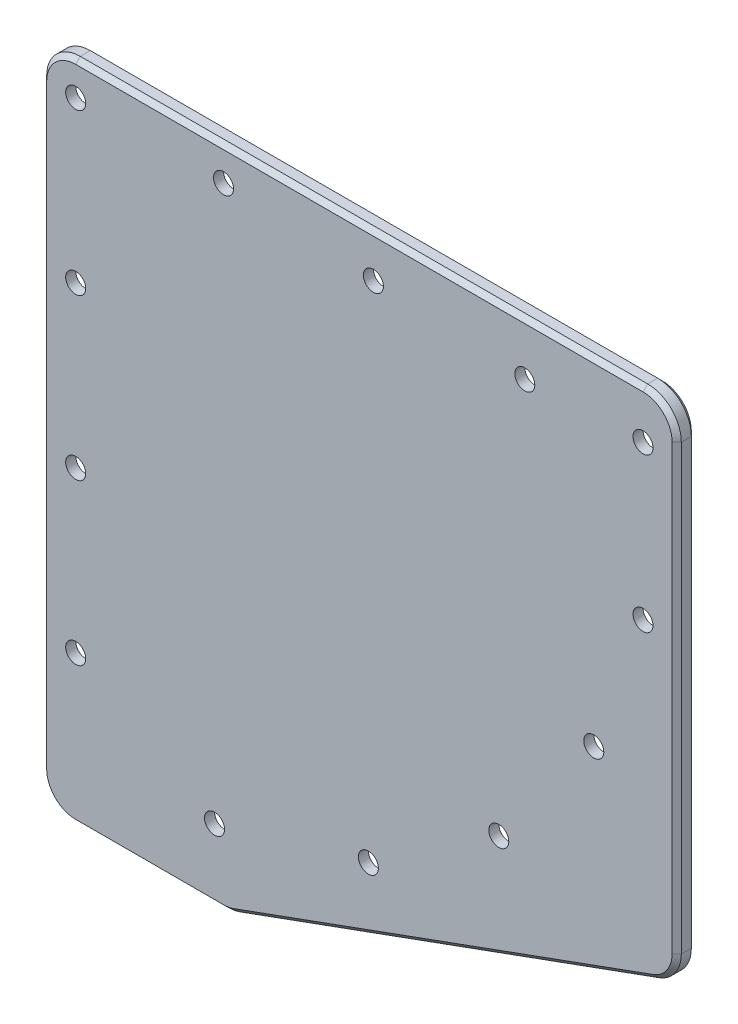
ISO-10303-21;
HEADER;
FILE_DESCRIPTION(('STEP AP214'),'2;1');
FILE_NAME('part.step','',(''),(''),'','','');
FILE_SCHEMA(('AUTOMOTIVE_DESIGN { 1 0 10303 214 1 1 1 1 }'));
ENDSEC;
DATA;
#1=APPLICATION_CONTEXT('core data for automotive mechanical design processes');
#2=APPLICATION_PROTOCOL_DEFINITION('international standard','automotive_design',2000,#1);
#3=PRODUCT_CONTEXT('',#1,'mechanical');
#4=PRODUCT('Part','Part','',(#3));
#5=PRODUCT_RELATED_PRODUCT_CATEGORY('part','',(#4));
#6=PRODUCT_DEFINITION_FORMATION('','',#4);
#7=PRODUCT_DEFINITION_CONTEXT('part definition',#1,'design');
#8=PRODUCT_DEFINITION('design','',#6,#7);
#9=PRODUCT_DEFINITION_SHAPE('','',#8);
#10=(LENGTH_UNIT() NAMED_UNIT(*) SI_UNIT(.MILLI.,.METRE.));
#11=(NAMED_UNIT(*) PLANE_ANGLE_UNIT() SI_UNIT($,.RADIAN.));
#12=(NAMED_UNIT(*) SI_UNIT($,.STERADIAN.) SOLID_ANGLE_UNIT());
#13=UNCERTAINTY_MEASURE_WITH_UNIT(LENGTH_MEASURE(1.E-05),#10,'distance_accuracy_value','');
#14=(GEOMETRIC_REPRESENTATION_CONTEXT(3) GLOBAL_UNCERTAINTY_ASSIGNED_CONTEXT((#13)) GLOBAL_UNIT_ASSIGNED_CONTEXT((#10,
#11,#12)) REPRESENTATION_CONTEXT('',''));
#15=CARTESIAN_POINT('',(0.,0.,0.));
#16=DIRECTION('',(0.,0.,1.));
#17=DIRECTION('',(1.,0.,0.));
#18=AXIS2_PLACEMENT_3D('',#15,#16,#17);
#19=CARTESIAN_POINT('',(0.,0.,-6.34999999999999));
#20=DIRECTION('',(0.,0.,-1.));
#21=DIRECTION('',(-1.,0.,0.));
#22=AXIS2_PLACEMENT_3D('',#19,#20,#21);
#23=PLANE('',#22);
#24=CARTESIAN_POINT('',(198.4248,-15.9258,-6.34999999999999));
#25=DIRECTION('',(0.,0.,-1.));
#26=DIRECTION('',(-1.,0.,0.));
#27=AXIS2_PLACEMENT_3D('',#24,#25,#26);
#28=CIRCLE('',#27,9.14400000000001);
#29=CARTESIAN_POINT('',(189.2808,-15.9258,-6.34999999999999));
#30=VERTEX_POINT('',#29);
#31=EDGE_CURVE('E448',#30,#30,#28,.F.);
#32=ORIENTED_EDGE('',*,*,#31,.T.);
#33=EDGE_LOOP('',(#32));
#34=FACE_BOUND('',#33,.T.);
#35=CARTESIAN_POINT('',(159.385,-17.4498,-6.34999999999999));
#36=DIRECTION('',(0.,0.,-1.));
#37=DIRECTION('',(-1.,0.,0.));
#38=AXIS2_PLACEMENT_3D('',#35,#36,#37);
#39=CIRCLE('',#38,9.14400000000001);
#40=CARTESIAN_POINT('',(150.241,-17.4498,-6.34999999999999));
#41=VERTEX_POINT('',#40);
#42=EDGE_CURVE('E445',#41,#41,#39,.F.);
#43=ORIENTED_EDGE('',*,*,#42,.T.);
#44=EDGE_LOOP('',(#43));
#45=FACE_BOUND('',#44,.T.);
#46=CARTESIAN_POINT('',(109.3978,-14.2748,-6.34999999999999));
#47=DIRECTION('',(0.,0.,-1.));
#48=DIRECTION('',(-1.,0.,0.));
#49=AXIS2_PLACEMENT_3D('',#46,#47,#48);
#50=CIRCLE('',#49,9.14400000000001);
#51=CARTESIAN_POINT('',(100.2538,-14.2748,-6.34999999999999));
#52=VERTEX_POINT('',#51);
#53=EDGE_CURVE('E442',#52,#52,#50,.F.);
#54=ORIENTED_EDGE('',*,*,#53,.T.);
#55=EDGE_LOOP('',(#54));
#56=FACE_BOUND('',#55,.T.);
#57=CARTESIAN_POINT('',(59.9186,-11.0998,-6.34999999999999));
#58=DIRECTION('',(0.,0.,-1.));
#59=DIRECTION('',(-1.,0.,0.));
#60=AXIS2_PLACEMENT_3D('',#57,#58,#59);
#61=CIRCLE('',#60,9.14400000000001);
#62=CARTESIAN_POINT('',(50.7746,-11.0998,-6.34999999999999));
#63=VERTEX_POINT('',#62);
#64=EDGE_CURVE('E439',#63,#63,#61,.F.);
#65=ORIENTED_EDGE('',*,*,#64,.T.);
#66=EDGE_LOOP('',(#65));
#67=FACE_BOUND('',#66,.T.);
#68=CARTESIAN_POINT('',(11.0998,-11.0998,-6.34999999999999));
#69=DIRECTION('',(0.,0.,-1.));
#70=DIRECTION('',(-1.,0.,0.));
#71=AXIS2_PLACEMENT_3D('',#68,#69,#70);
#72=CIRCLE('',#71,9.14400000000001);
#73=CARTESIAN_POINT('',(1.95579999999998,-11.0998,-6.34999999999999));
#74=VERTEX_POINT('',#73);
#75=EDGE_CURVE('E436',#74,#74,#72,.F.);
#76=ORIENTED_EDGE('',*,*,#75,.T.);
#77=EDGE_LOOP('',(#76));
#78=FACE_BOUND('',#77,.T.);
#79=CARTESIAN_POINT('',(11.0998,-64.008,-6.34999999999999));
#80=DIRECTION('',(0.,0.,-1.));
#81=DIRECTION('',(-1.,0.,0.));
#82=AXIS2_PLACEMENT_3D('',#79,#80,#81);
#83=CIRCLE('',#82,9.14400000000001);
#84=CARTESIAN_POINT('',(1.95579999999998,-64.008,-6.34999999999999));
#85=VERTEX_POINT('',#84);
#86=EDGE_CURVE('E433',#85,#85,#83,.F.);
#87=ORIENTED_EDGE('',*,*,#86,.T.);
#88=EDGE_LOOP('',(#87));
#89=FACE_BOUND('',#88,.T.);
#90=CARTESIAN_POINT('',(11.0998,-116.9162,-6.34999999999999));
#91=DIRECTION('',(0.,0.,-1.));
#92=DIRECTION('',(-1.,0.,0.));
#93=AXIS2_PLACEMENT_3D('',#90,#91,#92);
#94=CIRCLE('',#93,9.14400000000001);
#95=CARTESIAN_POINT('',(1.95579999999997,-116.9162,-6.34999999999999));
#96=VERTEX_POINT('',#95);
#97=EDGE_CURVE('E430',#96,#96,#94,.F.);
#98=ORIENTED_EDGE('',*,*,#97,.T.);
#99=EDGE_LOOP('',(#98));
#100=FACE_BOUND('',#99,.T.);
#101=CARTESIAN_POINT('',(11.0998,-169.8244,-6.34999999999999));
#102=DIRECTION('',(0.,0.,-1.));
#103=DIRECTION('',(-1.,0.,0.));
#104=AXIS2_PLACEMENT_3D('',#101,#102,#103);
#105=CIRCLE('',#104,9.14400000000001);
#106=CARTESIAN_POINT('',(1.95579999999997,-169.8244,-6.34999999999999));
#107=VERTEX_POINT('',#106);
#108=EDGE_CURVE('E427',#107,#107,#105,.F.);
#109=ORIENTED_EDGE('',*,*,#108,.T.);
#110=EDGE_LOOP('',(#109));
#111=FACE_BOUND('',#110,.T.);
#112=CARTESIAN_POINT('',(56.9468,-195.7324,-6.34999999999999));
#113=DIRECTION('',(0.,0.,-1.));
#114=DIRECTION('',(-1.,0.,0.));
#115=AXIS2_PLACEMENT_3D('',#112,#113,#114);
#116=CIRCLE('',#115,9.14400000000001);
#117=CARTESIAN_POINT('',(47.8028,-195.7324,-6.34999999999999));
#118=VERTEX_POINT('',#117);
#119=EDGE_CURVE('E424',#118,#118,#116,.F.);
#120=ORIENTED_EDGE('',*,*,#119,.T.);
#121=EDGE_LOOP('',(#120));
#122=FACE_BOUND('',#121,.T.);
#123=CARTESIAN_POINT('',(107.7468,-181.4576,-6.34999999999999));
#124=DIRECTION('',(0.,0.,-1.));
#125=DIRECTION('',(-1.,0.,0.));
#126=AXIS2_PLACEMENT_3D('',#123,#124,#125);
#127=CIRCLE('',#126,9.14400000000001);
#128=CARTESIAN_POINT('',(98.6028,-181.4576,-6.34999999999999));
#129=VERTEX_POINT('',#128);
#130=EDGE_CURVE('E421',#129,#129,#127,.F.);
#131=ORIENTED_EDGE('',*,*,#130,.T.);
#132=EDGE_LOOP('',(#131));
#133=FACE_BOUND('',#132,.T.);
#134=CARTESIAN_POINT('',(150.7998,-152.2984,-6.34999999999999));
#135=DIRECTION('',(0.,0.,-1.));
#136=DIRECTION('',(-1.,0.,0.));
#137=AXIS2_PLACEMENT_3D('',#134,#135,#136);
#138=CIRCLE('',#137,9.14400000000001);
#139=CARTESIAN_POINT('',(141.6558,-152.2984,-6.34999999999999));
#140=VERTEX_POINT('',#139);
#141=EDGE_CURVE('E418',#140,#140,#138,.F.);
#142=ORIENTED_EDGE('',*,*,#141,.T.);
#143=EDGE_LOOP('',(#142));
#144=FACE_BOUND('',#143,.T.);
#145=CARTESIAN_POINT('',(182.1688,-111.0234,-6.34999999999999));
#146=DIRECTION('',(0.,0.,-1.));
#147=DIRECTION('',(-1.,0.,0.));
#148=AXIS2_PLACEMENT_3D('',#145,#146,#147);
#149=CIRCLE('',#148,9.14400000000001);
#150=CARTESIAN_POINT('',(173.0248,-111.0234,-6.34999999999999));
#151=VERTEX_POINT('',#150);
#152=EDGE_CURVE('E415',#151,#151,#149,.F.);
#153=ORIENTED_EDGE('',*,*,#152,.T.);
#154=EDGE_LOOP('',(#153));
#155=FACE_BOUND('',#154,.T.);
#156=CARTESIAN_POINT('',(198.4248,-66.7258,-6.34999999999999));
#157=DIRECTION('',(0.,0.,-1.));
#158=DIRECTION('',(-1.,0.,0.));
#159=AXIS2_PLACEMENT_3D('',#156,#157,#158);
#160=CIRCLE('',#159,9.14400000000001);
#161=CARTESIAN_POINT('',(189.2808,-66.7258,-6.34999999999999));
#162=VERTEX_POINT('',#161);
#163=EDGE_CURVE('E412',#162,#162,#160,.F.);
#164=ORIENTED_EDGE('',*,*,#163,.T.);
#165=EDGE_LOOP('',(#164));
#166=FACE_BOUND('',#165,.T.);
#167=DIRECTION('',(0.,-1.,0.));
#168=VECTOR('',#167,1.);
#169=CARTESIAN_POINT('',(208.026,0.,-6.34999999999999));
#170=LINE('',#169,#168);
#171=CARTESIAN_POINT('',(208.026,-11.0998,-6.34999999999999));
#172=VERTEX_POINT('',#171);
#173=CARTESIAN_POINT('',(208.026,-157.46329301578,-6.34999999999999));
#174=VERTEX_POINT('',#173);
#175=EDGE_CURVE('E371',#172,#174,#170,.T.);
#176=ORIENTED_EDGE('',*,*,#175,.T.);
#177=CARTESIAN_POINT('',(198.4502,-157.46329301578,-6.34999999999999));
#178=DIRECTION('',(0.,0.,-1.));
#179=DIRECTION('',(-1.,0.,0.));
#180=AXIS2_PLACEMENT_3D('',#177,#178,#179);
#181=CIRCLE('',#180,9.5758);
#182=CARTESIAN_POINT('',(201.725316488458,-166.461601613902,-6.34999999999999));
#183=VERTEX_POINT('',#182);
#184=EDGE_CURVE('E373',#174,#183,#181,.T.);
#185=ORIENTED_EDGE('',*,*,#184,.T.);
#186=DIRECTION('',(-0.93969262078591,-0.342020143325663,0.));
#187=VECTOR('',#186,1.);
#188=CARTESIAN_POINT('',(77.0971068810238,-211.822560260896,-6.34999999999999));
#189=LINE('',#188,#187);
#190=CARTESIAN_POINT('',(63.2939222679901,-216.846508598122,-6.34999999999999));
#191=VERTEX_POINT('',#190);
#192=EDGE_CURVE('E369',#183,#191,#189,.T.);
#193=ORIENTED_EDGE('',*,*,#192,.T.);
#194=CARTESIAN_POINT('',(60.0188057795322,-207.8482,-6.34999999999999));
#195=DIRECTION('',(0.,0.,-1.));
#196=DIRECTION('',(-1.,0.,0.));
#197=AXIS2_PLACEMENT_3D('',#194,#195,#196);
#198=CIRCLE('',#197,9.57579999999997);
#199=CARTESIAN_POINT('',(60.0188057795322,-217.424,-6.34999999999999));
#200=VERTEX_POINT('',#199);
#201=EDGE_CURVE('E365',#191,#200,#198,.T.);
#202=ORIENTED_EDGE('',*,*,#201,.T.);
#203=DIRECTION('',(-1.,0.,0.));
#204=VECTOR('',#203,1.);
#205=CARTESIAN_POINT('',(0.,-217.424,-6.34999999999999));
#206=LINE('',#205,#204);
#207=CARTESIAN_POINT('',(11.0998,-217.424,-6.34999999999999));
#208=VERTEX_POINT('',#207);
#209=EDGE_CURVE('E361',#200,#208,#206,.T.);
#210=ORIENTED_EDGE('',*,*,#209,.T.);
#211=CARTESIAN_POINT('',(11.0998,-207.8482,-6.34999999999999));
#212=DIRECTION('',(0.,0.,-1.));
#213=DIRECTION('',(-1.,0.,0.));
#214=AXIS2_PLACEMENT_3D('',#211,#212,#213);
#215=CIRCLE('',#214,9.5758);
#216=CARTESIAN_POINT('',(1.52400000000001,-207.8482,-6.34999999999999));
#217=VERTEX_POINT('',#216);
#218=EDGE_CURVE('E357',#208,#217,#215,.T.);
#219=ORIENTED_EDGE('',*,*,#218,.T.);
#220=DIRECTION('',(0.,1.,0.));
#221=VECTOR('',#220,1.);
#222=CARTESIAN_POINT('',(1.52400000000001,0.,-6.34999999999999));
#223=LINE('',#222,#221);
#224=CARTESIAN_POINT('',(1.52400000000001,-11.0998,-6.34999999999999));
#225=VERTEX_POINT('',#224);
#226=EDGE_CURVE('E355',#217,#225,#223,.T.);
#227=ORIENTED_EDGE('',*,*,#226,.T.);
#228=CARTESIAN_POINT('',(11.0998,-11.0998,-6.34999999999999));
#229=DIRECTION('',(0.,0.,-1.));
#230=DIRECTION('',(-1.,0.,0.));
#231=AXIS2_PLACEMENT_3D('',#228,#229,#230);
#232=CIRCLE('',#231,9.57579999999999);
#233=CARTESIAN_POINT('',(11.0998,-1.52400000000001,-6.34999999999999));
#234=VERTEX_POINT('',#233);
#235=EDGE_CURVE('E359',#225,#234,#232,.T.);
#236=ORIENTED_EDGE('',*,*,#235,.T.);
#237=DIRECTION('',(1.,0.,0.));
#238=VECTOR('',#237,1.);
#239=CARTESIAN_POINT('',(0.,-1.52400000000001,-6.34999999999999));
#240=LINE('',#239,#238);
#241=CARTESIAN_POINT('',(198.4502,-1.52400000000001,-6.34999999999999));
#242=VERTEX_POINT('',#241);
#243=EDGE_CURVE('E363',#234,#242,#240,.T.);
#244=ORIENTED_EDGE('',*,*,#243,.T.);
#245=CARTESIAN_POINT('',(198.4502,-11.0998,-6.34999999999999));
#246=DIRECTION('',(0.,0.,-1.));
#247=DIRECTION('',(-1.,0.,0.));
#248=AXIS2_PLACEMENT_3D('',#245,#246,#247);
#249=CIRCLE('',#248,9.5758);
#250=EDGE_CURVE('E367',#242,#172,#249,.T.);
#251=ORIENTED_EDGE('',*,*,#250,.T.);
#252=EDGE_LOOP('',(#176,#185,#193,#202,#210,#219,#227,#236,#244,#251));
#253=FACE_BOUND('',#252,.T.);
#254=ADVANCED_FACE('F17',(#34,#45,#56,#67,#78,#89,#100,#111,#122,#133,#144,#155,#166,#253),#23,.T.);
#255=CARTESIAN_POINT('',(0.,-218.948,-6.34999999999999));
#256=DIRECTION('',(-1.,0.,0.));
#257=DIRECTION('',(0.,0.,1.));
#258=AXIS2_PLACEMENT_3D('',#255,#256,#257);
#259=PLANE('',#258);
#260=DIRECTION('',(0.,0.,1.));
#261=VECTOR('',#260,1.);
#262=CARTESIAN_POINT('',(0.,-207.8482,-6.34999999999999));
#263=LINE('',#262,#261);
#264=CARTESIAN_POINT('',(0.,-207.8482,-4.82599999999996));
#265=VERTEX_POINT('',#264);
#266=CARTESIAN_POINT('',(0.,-207.8482,-1.52400000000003));
#267=VERTEX_POINT('',#266);
#268=EDGE_CURVE('E314',#265,#267,#263,.T.);
#269=ORIENTED_EDGE('',*,*,#268,.T.);
#270=DIRECTION('',(0.,1.,0.));
#271=VECTOR('',#270,1.);
#272=CARTESIAN_POINT('',(0.,-11.0998,-1.52400000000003));
#273=LINE('',#272,#271);
#274=CARTESIAN_POINT('',(0.,-11.0998,-1.52400000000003));
#275=VERTEX_POINT('',#274);
#276=EDGE_CURVE('E407',#267,#275,#273,.T.);
#277=ORIENTED_EDGE('',*,*,#276,.T.);
#278=DIRECTION('',(0.,0.,1.));
#279=VECTOR('',#278,1.);
#280=CARTESIAN_POINT('',(0.,-11.0998,-6.34999999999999));
#281=LINE('',#280,#279);
#282=CARTESIAN_POINT('',(0.,-11.0998,-4.82599999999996));
#283=VERTEX_POINT('',#282);
#284=EDGE_CURVE('E316',#275,#283,#281,.F.);
#285=ORIENTED_EDGE('',*,*,#284,.T.);
#286=DIRECTION('',(0.,-1.,0.));
#287=VECTOR('',#286,1.);
#288=CARTESIAN_POINT('',(0.,-218.948,-4.82599999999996));
#289=LINE('',#288,#287);
#290=EDGE_CURVE('E39',#283,#265,#289,.T.);
#291=ORIENTED_EDGE('',*,*,#290,.T.);
#292=EDGE_LOOP('',(#269,#277,#285,#291));
#293=FACE_BOUND('',#292,.T.);
#294=ADVANCED_FACE('F19',(#293),#259,.T.);
#295=CARTESIAN_POINT('',(0.,0.,-6.34999999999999));
#296=DIRECTION('',(0.,1.,0.));
#297=DIRECTION('',(0.,0.,1.));
#298=AXIS2_PLACEMENT_3D('',#295,#296,#297);
#299=PLANE('',#298);
#300=DIRECTION('',(0.,0.,1.));
#301=VECTOR('',#300,1.);
#302=CARTESIAN_POINT('',(11.0998,0.,-6.34999999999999));
#303=LINE('',#302,#301);
#304=CARTESIAN_POINT('',(11.0998,0.,-4.82599999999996));
#305=VERTEX_POINT('',#304);
#306=CARTESIAN_POINT('',(11.0998,0.,-1.52400000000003));
#307=VERTEX_POINT('',#306);
#308=EDGE_CURVE('E311',#305,#307,#303,.T.);
#309=ORIENTED_EDGE('',*,*,#308,.T.);
#310=DIRECTION('',(1.,0.,0.));
#311=VECTOR('',#310,1.);
#312=CARTESIAN_POINT('',(198.4502,0.,-1.52400000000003));
#313=LINE('',#312,#311);
#314=CARTESIAN_POINT('',(198.4502,0.,-1.52400000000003));
#315=VERTEX_POINT('',#314);
#316=EDGE_CURVE('E394',#307,#315,#313,.T.);
#317=ORIENTED_EDGE('',*,*,#316,.T.);
#318=DIRECTION('',(0.,0.,1.));
#319=VECTOR('',#318,1.);
#320=CARTESIAN_POINT('',(198.4502,0.,-6.34999999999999));
#321=LINE('',#320,#319);
#322=CARTESIAN_POINT('',(198.4502,0.,-4.82599999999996));
#323=VERTEX_POINT('',#322);
#324=EDGE_CURVE('E308',#315,#323,#321,.F.);
#325=ORIENTED_EDGE('',*,*,#324,.T.);
#326=DIRECTION('',(-1.,0.,0.));
#327=VECTOR('',#326,1.);
#328=CARTESIAN_POINT('',(0.,0.,-4.82599999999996));
#329=LINE('',#328,#327);
#330=EDGE_CURVE('E392',#323,#305,#329,.T.);
#331=ORIENTED_EDGE('',*,*,#330,.T.);
#332=EDGE_LOOP('',(#309,#317,#325,#331));
#333=FACE_BOUND('',#332,.T.);
#334=ADVANCED_FACE('F511',(#333),#299,.T.);
#335=CARTESIAN_POINT('',(209.55,0.,-6.34999999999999));
#336=DIRECTION('',(1.,0.,0.));
#337=DIRECTION('',(0.,1.,0.));
#338=AXIS2_PLACEMENT_3D('',#335,#336,#337);
#339=PLANE('',#338);
#340=DIRECTION('',(0.,0.,1.));
#341=VECTOR('',#340,1.);
#342=CARTESIAN_POINT('',(209.55,-11.0998,-6.34999999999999));
#343=LINE('',#342,#341);
#344=CARTESIAN_POINT('',(209.55,-11.0998,-4.82599999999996));
#345=VERTEX_POINT('',#344);
#346=CARTESIAN_POINT('',(209.55,-11.0998,-1.52400000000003));
#347=VERTEX_POINT('',#346);
#348=EDGE_CURVE('E330',#345,#347,#343,.T.);
#349=ORIENTED_EDGE('',*,*,#348,.T.);
#350=DIRECTION('',(0.,-1.,0.));
#351=VECTOR('',#350,1.);
#352=CARTESIAN_POINT('',(209.55,-157.46329301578,-1.52400000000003));
#353=LINE('',#352,#351);
#354=CARTESIAN_POINT('',(209.55,-157.46329301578,-1.52400000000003));
#355=VERTEX_POINT('',#354);
#356=EDGE_CURVE('E378',#347,#355,#353,.T.);
#357=ORIENTED_EDGE('',*,*,#356,.T.);
#358=DIRECTION('',(0.,0.,1.));
#359=VECTOR('',#358,1.);
#360=CARTESIAN_POINT('',(209.55,-157.46329301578,-6.34999999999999));
#361=LINE('',#360,#359);
#362=CARTESIAN_POINT('',(209.55,-157.46329301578,-4.82599999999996));
#363=VERTEX_POINT('',#362);
#364=EDGE_CURVE('E179',#355,#363,#361,.F.);
#365=ORIENTED_EDGE('',*,*,#364,.T.);
#366=DIRECTION('',(0.,1.,0.));
#367=VECTOR('',#366,1.);
#368=CARTESIAN_POINT('',(209.55,0.,-4.82599999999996));
#369=LINE('',#368,#367);
#370=EDGE_CURVE('E376',#363,#345,#369,.T.);
#371=ORIENTED_EDGE('',*,*,#370,.T.);
#372=EDGE_LOOP('',(#349,#357,#365,#371));
#373=FACE_BOUND('',#372,.T.);
#374=ADVANCED_FACE('F518',(#373),#339,.T.);
#375=CARTESIAN_POINT('',(61.976,-218.948,-6.34999999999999));
#376=DIRECTION('',(0.342020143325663,-0.93969262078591,0.));
#377=DIRECTION('',(0.93969262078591,0.342020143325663,0.));
#378=AXIS2_PLACEMENT_3D('',#375,#376,#377);
#379=PLANE('',#378);
#380=DIRECTION('',(0.,0.,1.));
#381=VECTOR('',#380,1.);
#382=CARTESIAN_POINT('',(202.246555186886,-167.89369316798,-6.34999999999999));
#383=LINE('',#382,#381);
#384=CARTESIAN_POINT('',(202.246555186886,-167.89369316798,-4.82599999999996));
#385=VERTEX_POINT('',#384);
#386=CARTESIAN_POINT('',(202.246555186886,-167.89369316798,-1.52400000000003));
#387=VERTEX_POINT('',#386);
#388=EDGE_CURVE('E324',#385,#387,#383,.T.);
#389=ORIENTED_EDGE('',*,*,#388,.T.);
#390=DIRECTION('',(-0.93969262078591,-0.342020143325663,0.));
#391=VECTOR('',#390,1.);
#392=CARTESIAN_POINT('',(63.8151609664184,-218.278600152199,-1.52400000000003));
#393=LINE('',#392,#391);
#394=CARTESIAN_POINT('',(63.8151609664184,-218.278600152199,-1.52400000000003));
#395=VERTEX_POINT('',#394);
#396=EDGE_CURVE('E382',#387,#395,#393,.T.);
#397=ORIENTED_EDGE('',*,*,#396,.T.);
#398=DIRECTION('',(0.,0.,1.));
#399=VECTOR('',#398,1.);
#400=CARTESIAN_POINT('',(63.8151609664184,-218.278600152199,-6.34999999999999));
#401=LINE('',#400,#399);
#402=CARTESIAN_POINT('',(63.8151609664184,-218.278600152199,-4.82599999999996));
#403=VERTEX_POINT('',#402);
#404=EDGE_CURVE('E327',#395,#403,#401,.F.);
#405=ORIENTED_EDGE('',*,*,#404,.T.);
#406=DIRECTION('',(0.93969262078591,0.342020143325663,0.));
#407=VECTOR('',#406,1.);
#408=CARTESIAN_POINT('',(61.976,-218.948,-4.82599999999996));
#409=LINE('',#408,#407);
#410=EDGE_CURVE('E380',#403,#385,#409,.T.);
#411=ORIENTED_EDGE('',*,*,#410,.T.);
#412=EDGE_LOOP('',(#389,#397,#405,#411));
#413=FACE_BOUND('',#412,.T.);
#414=ADVANCED_FACE('F522',(#413),#379,.T.);
#415=CARTESIAN_POINT('',(61.976,-218.948,-6.34999999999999));
#416=DIRECTION('',(0.,-1.,0.));
#417=DIRECTION('',(0.,0.,-1.));
#418=AXIS2_PLACEMENT_3D('',#415,#416,#417);
#419=PLANE('',#418);
#420=DIRECTION('',(0.,0.,1.));
#421=VECTOR('',#420,1.);
#422=CARTESIAN_POINT('',(60.0188057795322,-218.948,-6.34999999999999));
#423=LINE('',#422,#421);
#424=CARTESIAN_POINT('',(60.0188057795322,-218.948,-4.82599999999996));
#425=VERTEX_POINT('',#424);
#426=CARTESIAN_POINT('',(60.0188057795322,-218.948,-1.52400000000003));
#427=VERTEX_POINT('',#426);
#428=EDGE_CURVE('E318',#425,#427,#423,.T.);
#429=ORIENTED_EDGE('',*,*,#428,.T.);
#430=DIRECTION('',(-1.,0.,0.));
#431=VECTOR('',#430,1.);
#432=CARTESIAN_POINT('',(11.0998,-218.948,-1.52400000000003));
#433=LINE('',#432,#431);
#434=CARTESIAN_POINT('',(11.0998,-218.948,-1.52400000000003));
#435=VERTEX_POINT('',#434);
#436=EDGE_CURVE('E398',#427,#435,#433,.T.);
#437=ORIENTED_EDGE('',*,*,#436,.T.);
#438=DIRECTION('',(0.,0.,1.));
#439=VECTOR('',#438,1.);
#440=CARTESIAN_POINT('',(11.0998,-218.948,-6.34999999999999));
#441=LINE('',#440,#439);
#442=CARTESIAN_POINT('',(11.0998,-218.948,-4.82599999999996));
#443=VERTEX_POINT('',#442);
#444=EDGE_CURVE('E321',#435,#443,#441,.F.);
#445=ORIENTED_EDGE('',*,*,#444,.T.);
#446=DIRECTION('',(1.,0.,0.));
#447=VECTOR('',#446,1.);
#448=CARTESIAN_POINT('',(61.976,-218.948,-4.82599999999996));
#449=LINE('',#448,#447);
#450=EDGE_CURVE('E396',#443,#425,#449,.T.);
#451=ORIENTED_EDGE('',*,*,#450,.T.);
#452=EDGE_LOOP('',(#429,#437,#445,#451));
#453=FACE_BOUND('',#452,.T.);
#454=ADVANCED_FACE('F525',(#453),#419,.T.);
#455=CARTESIAN_POINT('',(0.,0.,0.));
#456=DIRECTION('',(0.,0.,-1.));
#457=DIRECTION('',(-1.,0.,0.));
#458=AXIS2_PLACEMENT_3D('',#455,#456,#457);
#459=PLANE('',#458);
#460=DIRECTION('',(0.93969262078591,0.342020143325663,0.));
#461=VECTOR('',#460,1.);
#462=CARTESIAN_POINT('',(201.725316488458,-166.461601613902,0.));
#463=LINE('',#462,#461);
#464=CARTESIAN_POINT('',(63.2939222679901,-216.846508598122,0.));
#465=VERTEX_POINT('',#464);
#466=CARTESIAN_POINT('',(201.725316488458,-166.461601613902,0.));
#467=VERTEX_POINT('',#466);
#468=EDGE_CURVE('E342',#465,#467,#463,.T.);
#469=ORIENTED_EDGE('',*,*,#468,.T.);
#470=CARTESIAN_POINT('',(198.4502,-157.46329301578,0.));
#471=DIRECTION('',(0.,0.,-1.));
#472=DIRECTION('',(-1.,0.,0.));
#473=AXIS2_PLACEMENT_3D('',#470,#471,#472);
#474=CIRCLE('',#473,9.5758);
#475=CARTESIAN_POINT('',(208.026,-157.46329301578,0.));
#476=VERTEX_POINT('',#475);
#477=EDGE_CURVE('E346',#467,#476,#474,.F.);
#478=ORIENTED_EDGE('',*,*,#477,.T.);
#479=DIRECTION('',(0.,1.,0.));
#480=VECTOR('',#479,1.);
#481=CARTESIAN_POINT('',(208.026,-11.0998,0.));
#482=LINE('',#481,#480);
#483=CARTESIAN_POINT('',(208.026,-11.0998,0.));
#484=VERTEX_POINT('',#483);
#485=EDGE_CURVE('E344',#476,#484,#482,.T.);
#486=ORIENTED_EDGE('',*,*,#485,.T.);
#487=CARTESIAN_POINT('',(198.4502,-11.0998,0.));
#488=DIRECTION('',(0.,0.,-1.));
#489=DIRECTION('',(-1.,0.,0.));
#490=AXIS2_PLACEMENT_3D('',#487,#488,#489);
#491=CIRCLE('',#490,9.57579999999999);
#492=CARTESIAN_POINT('',(198.4502,-1.52400000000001,0.));
#493=VERTEX_POINT('',#492);
#494=EDGE_CURVE('E340',#484,#493,#491,.F.);
#495=ORIENTED_EDGE('',*,*,#494,.T.);
#496=DIRECTION('',(-1.,0.,0.));
#497=VECTOR('',#496,1.);
#498=CARTESIAN_POINT('',(11.0998,-1.52400000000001,0.));
#499=LINE('',#498,#497);
#500=CARTESIAN_POINT('',(11.0998,-1.52400000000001,0.));
#501=VERTEX_POINT('',#500);
#502=EDGE_CURVE('E162',#493,#501,#499,.T.);
#503=ORIENTED_EDGE('',*,*,#502,.T.);
#504=CARTESIAN_POINT('',(11.0998,-11.0998,0.));
#505=DIRECTION('',(0.,0.,-1.));
#506=DIRECTION('',(-1.,0.,0.));
#507=AXIS2_PLACEMENT_3D('',#504,#505,#506);
#508=CIRCLE('',#507,9.57579999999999);
#509=CARTESIAN_POINT('',(1.52400000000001,-11.0998,0.));
#510=VERTEX_POINT('',#509);
#511=EDGE_CURVE('E155',#501,#510,#508,.F.);
#512=ORIENTED_EDGE('',*,*,#511,.T.);
#513=DIRECTION('',(0.,-1.,0.));
#514=VECTOR('',#513,1.);
#515=CARTESIAN_POINT('',(1.52400000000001,-207.8482,0.));
#516=LINE('',#515,#514);
#517=CARTESIAN_POINT('',(1.52400000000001,-207.8482,0.));
#518=VERTEX_POINT('',#517);
#519=EDGE_CURVE('E159',#510,#518,#516,.T.);
#520=ORIENTED_EDGE('',*,*,#519,.T.);
#521=CARTESIAN_POINT('',(11.0998,-207.8482,0.));
#522=DIRECTION('',(0.,0.,-1.));
#523=DIRECTION('',(-1.,0.,0.));
#524=AXIS2_PLACEMENT_3D('',#521,#522,#523);
#525=CIRCLE('',#524,9.5758);
#526=CARTESIAN_POINT('',(11.0998,-217.424,0.));
#527=VERTEX_POINT('',#526);
#528=EDGE_CURVE('E168',#518,#527,#525,.F.);
#529=ORIENTED_EDGE('',*,*,#528,.T.);
#530=DIRECTION('',(1.,0.,0.));
#531=VECTOR('',#530,1.);
#532=CARTESIAN_POINT('',(60.0188057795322,-217.424,0.));
#533=LINE('',#532,#531);
#534=CARTESIAN_POINT('',(60.0188057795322,-217.424,0.));
#535=VERTEX_POINT('',#534);
#536=EDGE_CURVE('E167',#527,#535,#533,.T.);
#537=ORIENTED_EDGE('',*,*,#536,.T.);
#538=CARTESIAN_POINT('',(60.0188057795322,-207.8482,0.));
#539=DIRECTION('',(0.,0.,-1.));
#540=DIRECTION('',(-1.,0.,0.));
#541=AXIS2_PLACEMENT_3D('',#538,#539,#540);
#542=CIRCLE('',#541,9.57579999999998);
#543=EDGE_CURVE('E338',#535,#465,#542,.F.);
#544=ORIENTED_EDGE('',*,*,#543,.T.);
#545=EDGE_LOOP('',(#469,#478,#486,#495,#503,#512,#520,#529,#537,#544));
#546=FACE_BOUND('',#545,.T.);
#547=CARTESIAN_POINT('',(11.0998,-11.0998,0.));
#548=DIRECTION('',(0.,0.,-1.));
#549=DIRECTION('',(-1.,0.,0.));
#550=AXIS2_PLACEMENT_3D('',#547,#548,#549);
#551=CIRCLE('',#550,3.30200000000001);
#552=CARTESIAN_POINT('',(7.79779999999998,-11.0998,0.));
#553=VERTEX_POINT('',#552);
#554=EDGE_CURVE('E185',#553,#553,#551,.T.);
#555=ORIENTED_EDGE('',*,*,#554,.T.);
#556=EDGE_LOOP('',(#555));
#557=FACE_BOUND('',#556,.T.);
#558=CARTESIAN_POINT('',(59.9186,-11.0998,0.));
#559=DIRECTION('',(0.,0.,-1.));
#560=DIRECTION('',(-1.,0.,0.));
#561=AXIS2_PLACEMENT_3D('',#558,#559,#560);
#562=CIRCLE('',#561,3.30200000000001);
#563=CARTESIAN_POINT('',(56.6166,-11.0998,0.));
#564=VERTEX_POINT('',#563);
#565=EDGE_CURVE('E200',#564,#564,#562,.T.);
#566=ORIENTED_EDGE('',*,*,#565,.T.);
#567=EDGE_LOOP('',(#566));
#568=FACE_BOUND('',#567,.T.);
#569=CARTESIAN_POINT('',(109.3978,-14.2748,0.));
#570=DIRECTION('',(0.,0.,-1.));
#571=DIRECTION('',(-1.,0.,0.));
#572=AXIS2_PLACEMENT_3D('',#569,#570,#571);
#573=CIRCLE('',#572,3.30200000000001);
#574=CARTESIAN_POINT('',(106.0958,-14.2748,0.));
#575=VERTEX_POINT('',#574);
#576=EDGE_CURVE('E209',#575,#575,#573,.T.);
#577=ORIENTED_EDGE('',*,*,#576,.T.);
#578=EDGE_LOOP('',(#577));
#579=FACE_BOUND('',#578,.T.);
#580=CARTESIAN_POINT('',(159.385,-17.4498,0.));
#581=DIRECTION('',(0.,0.,-1.));
#582=DIRECTION('',(-1.,0.,0.));
#583=AXIS2_PLACEMENT_3D('',#580,#581,#582);
#584=CIRCLE('',#583,3.302);
#585=CARTESIAN_POINT('',(156.083,-17.4498,0.));
#586=VERTEX_POINT('',#585);
#587=EDGE_CURVE('E218',#586,#586,#584,.T.);
#588=ORIENTED_EDGE('',*,*,#587,.T.);
#589=EDGE_LOOP('',(#588));
#590=FACE_BOUND('',#589,.T.);
#591=CARTESIAN_POINT('',(198.4248,-15.9258,0.));
#592=DIRECTION('',(0.,0.,-1.));
#593=DIRECTION('',(-1.,0.,0.));
#594=AXIS2_PLACEMENT_3D('',#591,#592,#593);
#595=CIRCLE('',#594,3.302);
#596=CARTESIAN_POINT('',(195.1228,-15.9258,0.));
#597=VERTEX_POINT('',#596);
#598=EDGE_CURVE('E227',#597,#597,#595,.T.);
#599=ORIENTED_EDGE('',*,*,#598,.T.);
#600=EDGE_LOOP('',(#599));
#601=FACE_BOUND('',#600,.T.);
#602=CARTESIAN_POINT('',(198.4248,-66.7258,0.));
#603=DIRECTION('',(0.,0.,-1.));
#604=DIRECTION('',(-1.,0.,0.));
#605=AXIS2_PLACEMENT_3D('',#602,#603,#604);
#606=CIRCLE('',#605,3.302);
#607=CARTESIAN_POINT('',(195.1228,-66.7258,0.));
#608=VERTEX_POINT('',#607);
#609=EDGE_CURVE('E236',#608,#608,#606,.T.);
#610=ORIENTED_EDGE('',*,*,#609,.T.);
#611=EDGE_LOOP('',(#610));
#612=FACE_BOUND('',#611,.T.);
#613=CARTESIAN_POINT('',(182.1688,-111.0234,0.));
#614=DIRECTION('',(0.,0.,-1.));
#615=DIRECTION('',(-1.,0.,0.));
#616=AXIS2_PLACEMENT_3D('',#613,#614,#615);
#617=CIRCLE('',#616,3.302);
#618=CARTESIAN_POINT('',(178.8668,-111.0234,0.));
#619=VERTEX_POINT('',#618);
#620=EDGE_CURVE('E245',#619,#619,#617,.T.);
#621=ORIENTED_EDGE('',*,*,#620,.T.);
#622=EDGE_LOOP('',(#621));
#623=FACE_BOUND('',#622,.T.);
#624=CARTESIAN_POINT('',(150.7998,-152.2984,0.));
#625=DIRECTION('',(0.,0.,-1.));
#626=DIRECTION('',(-1.,0.,0.));
#627=AXIS2_PLACEMENT_3D('',#624,#625,#626);
#628=CIRCLE('',#627,3.302);
#629=CARTESIAN_POINT('',(147.4978,-152.2984,0.));
#630=VERTEX_POINT('',#629);
#631=EDGE_CURVE('E254',#630,#630,#628,.T.);
#632=ORIENTED_EDGE('',*,*,#631,.T.);
#633=EDGE_LOOP('',(#632));
#634=FACE_BOUND('',#633,.T.);
#635=CARTESIAN_POINT('',(107.7468,-181.4576,0.));
#636=DIRECTION('',(0.,0.,-1.));
#637=DIRECTION('',(-1.,0.,0.));
#638=AXIS2_PLACEMENT_3D('',#635,#636,#637);
#639=CIRCLE('',#638,3.30200000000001);
#640=CARTESIAN_POINT('',(104.4448,-181.4576,0.));
#641=VERTEX_POINT('',#640);
#642=EDGE_CURVE('E263',#641,#641,#639,.T.);
#643=ORIENTED_EDGE('',*,*,#642,.T.);
#644=EDGE_LOOP('',(#643));
#645=FACE_BOUND('',#644,.T.);
#646=CARTESIAN_POINT('',(56.9468,-195.7324,0.));
#647=DIRECTION('',(0.,0.,-1.));
#648=DIRECTION('',(-1.,0.,0.));
#649=AXIS2_PLACEMENT_3D('',#646,#647,#648);
#650=CIRCLE('',#649,3.30200000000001);
#651=CARTESIAN_POINT('',(53.6448,-195.7324,0.));
#652=VERTEX_POINT('',#651);
#653=EDGE_CURVE('E272',#652,#652,#650,.T.);
#654=ORIENTED_EDGE('',*,*,#653,.T.);
#655=EDGE_LOOP('',(#654));
#656=FACE_BOUND('',#655,.T.);
#657=CARTESIAN_POINT('',(11.0998,-169.8244,0.));
#658=DIRECTION('',(0.,0.,-1.));
#659=DIRECTION('',(-1.,0.,0.));
#660=AXIS2_PLACEMENT_3D('',#657,#658,#659);
#661=CIRCLE('',#660,3.30200000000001);
#662=CARTESIAN_POINT('',(7.79779999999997,-169.8244,0.));
#663=VERTEX_POINT('',#662);
#664=EDGE_CURVE('E281',#663,#663,#661,.T.);
#665=ORIENTED_EDGE('',*,*,#664,.T.);
#666=EDGE_LOOP('',(#665));
#667=FACE_BOUND('',#666,.T.);
#668=CARTESIAN_POINT('',(11.0998,-116.9162,0.));
#669=DIRECTION('',(0.,0.,-1.));
#670=DIRECTION('',(-1.,0.,0.));
#671=AXIS2_PLACEMENT_3D('',#668,#669,#670);
#672=CIRCLE('',#671,3.30200000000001);
#673=CARTESIAN_POINT('',(7.79779999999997,-116.9162,0.));
#674=VERTEX_POINT('',#673);
#675=EDGE_CURVE('E290',#674,#674,#672,.T.);
#676=ORIENTED_EDGE('',*,*,#675,.T.);
#677=EDGE_LOOP('',(#676));
#678=FACE_BOUND('',#677,.T.);
#679=CARTESIAN_POINT('',(11.0998,-64.008,0.));
#680=DIRECTION('',(0.,0.,-1.));
#681=DIRECTION('',(-1.,0.,0.));
#682=AXIS2_PLACEMENT_3D('',#679,#680,#681);
#683=CIRCLE('',#682,3.30200000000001);
#684=CARTESIAN_POINT('',(7.79779999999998,-64.008,0.));
#685=VERTEX_POINT('',#684);
#686=EDGE_CURVE('E299',#685,#685,#683,.T.);
#687=ORIENTED_EDGE('',*,*,#686,.T.);
#688=EDGE_LOOP('',(#687));
#689=FACE_BOUND('',#688,.T.);
#690=ADVANCED_FACE('F157',(#546,#557,#568,#579,#590,#601,#612,#623,#634,#645,#656,#667,#678,
#689),#459,.F.);
#691=CARTESIAN_POINT('',(11.0998,-64.008,-6.34999999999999));
#692=DIRECTION('',(0.,0.,-1.));
#693=DIRECTION('',(-1.,0.,0.));
#694=AXIS2_PLACEMENT_3D('',#691,#692,#693);
#695=CYLINDRICAL_SURFACE('',#694,8.38200000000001);
#696=CARTESIAN_POINT('',(11.0998,-64.008,-5.58799999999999));
#697=DIRECTION('',(0.,0.,-1.));
#698=DIRECTION('',(-1.,0.,0.));
#699=AXIS2_PLACEMENT_3D('',#696,#697,#698);
#700=CIRCLE('',#699,8.38200000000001);
#701=CARTESIAN_POINT('',(2.71779999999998,-64.008,-5.58799999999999));
#702=VERTEX_POINT('',#701);
#703=EDGE_CURVE('E463',#702,#702,#700,.T.);
#704=ORIENTED_EDGE('',*,*,#703,.T.);
#705=EDGE_LOOP('',(#704));
#706=FACE_BOUND('',#705,.T.);
#707=CARTESIAN_POINT('',(11.0998,-64.008,-3.32739999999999));
#708=DIRECTION('',(0.,0.,-1.));
#709=DIRECTION('',(-1.,0.,0.));
#710=AXIS2_PLACEMENT_3D('',#707,#708,#709);
#711=CIRCLE('',#710,8.38200000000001);
#712=CARTESIAN_POINT('',(2.71779999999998,-64.008,-3.32739999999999));
#713=VERTEX_POINT('',#712);
#714=EDGE_CURVE('E305',#713,#713,#711,.T.);
#715=ORIENTED_EDGE('',*,*,#714,.F.);
#716=EDGE_LOOP('',(#715));
#717=FACE_BOUND('',#716,.T.);
#718=ADVANCED_FACE('F533',(#706,#717),#695,.F.);
#719=CARTESIAN_POINT('',(14.4018,-64.008,-3.32739999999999));
#720=DIRECTION('',(0.,0.,1.));
#721=DIRECTION('',(1.,0.,0.));
#722=AXIS2_PLACEMENT_3D('',#719,#720,#721);
#723=PLANE('',#722);
#724=CARTESIAN_POINT('',(11.0998,-64.008,-3.32739999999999));
#725=DIRECTION('',(0.,0.,-1.));
#726=DIRECTION('',(-1.,0.,0.));
#727=AXIS2_PLACEMENT_3D('',#724,#725,#726);
#728=CIRCLE('',#727,3.30200000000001);
#729=CARTESIAN_POINT('',(7.79779999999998,-64.008,-3.32739999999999));
#730=VERTEX_POINT('',#729);
#731=EDGE_CURVE('E302',#730,#730,#728,.T.);
#732=ORIENTED_EDGE('',*,*,#731,.F.);
#733=EDGE_LOOP('',(#732));
#734=FACE_BOUND('',#733,.T.);
#735=ORIENTED_EDGE('',*,*,#714,.T.);
#736=EDGE_LOOP('',(#735));
#737=FACE_BOUND('',#736,.T.);
#738=ADVANCED_FACE('F858',(#734,#737),#723,.F.);
#739=CARTESIAN_POINT('',(11.0998,-64.008,-6.34999999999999));
#740=DIRECTION('',(0.,0.,-1.));
#741=DIRECTION('',(-1.,0.,0.));
#742=AXIS2_PLACEMENT_3D('',#739,#740,#741);
#743=CYLINDRICAL_SURFACE('',#742,3.30200000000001);
#744=ORIENTED_EDGE('',*,*,#686,.F.);
#745=EDGE_LOOP('',(#744));
#746=FACE_BOUND('',#745,.T.);
#747=ORIENTED_EDGE('',*,*,#731,.T.);
#748=EDGE_LOOP('',(#747));
#749=FACE_BOUND('',#748,.T.);
#750=ADVANCED_FACE('F854',(#746,#749),#743,.F.);
#751=CARTESIAN_POINT('',(11.0998,-116.9162,-6.34999999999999));
#752=DIRECTION('',(0.,0.,-1.));
#753=DIRECTION('',(-1.,0.,0.));
#754=AXIS2_PLACEMENT_3D('',#751,#752,#753);
#755=CYLINDRICAL_SURFACE('',#754,8.38200000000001);
#756=CARTESIAN_POINT('',(11.0998,-116.9162,-5.58799999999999));
#757=DIRECTION('',(0.,0.,-1.));
#758=DIRECTION('',(-1.,0.,0.));
#759=AXIS2_PLACEMENT_3D('',#756,#757,#758);
#760=CIRCLE('',#759,8.38200000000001);
#761=CARTESIAN_POINT('',(2.71779999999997,-116.9162,-5.58799999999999));
#762=VERTEX_POINT('',#761);
#763=EDGE_CURVE('E466',#762,#762,#760,.T.);
#764=ORIENTED_EDGE('',*,*,#763,.T.);
#765=EDGE_LOOP('',(#764));
#766=FACE_BOUND('',#765,.T.);
#767=CARTESIAN_POINT('',(11.0998,-116.9162,-3.32739999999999));
#768=DIRECTION('',(0.,0.,-1.));
#769=DIRECTION('',(-1.,0.,0.));
#770=AXIS2_PLACEMENT_3D('',#767,#768,#769);
#771=CIRCLE('',#770,8.38200000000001);
#772=CARTESIAN_POINT('',(2.71779999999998,-116.9162,-3.32739999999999));
#773=VERTEX_POINT('',#772);
#774=EDGE_CURVE('E296',#773,#773,#771,.T.);
#775=ORIENTED_EDGE('',*,*,#774,.F.);
#776=EDGE_LOOP('',(#775));
#777=FACE_BOUND('',#776,.T.);
#778=ADVANCED_FACE('F850',(#766,#777),#755,.F.);
#779=CARTESIAN_POINT('',(14.4018,-116.9162,-3.32739999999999));
#780=DIRECTION('',(0.,0.,1.));
#781=DIRECTION('',(1.,0.,0.));
#782=AXIS2_PLACEMENT_3D('',#779,#780,#781);
#783=PLANE('',#782);
#784=CARTESIAN_POINT('',(11.0998,-116.9162,-3.32739999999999));
#785=DIRECTION('',(0.,0.,-1.));
#786=DIRECTION('',(-1.,0.,0.));
#787=AXIS2_PLACEMENT_3D('',#784,#785,#786);
#788=CIRCLE('',#787,3.30200000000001);
#789=CARTESIAN_POINT('',(7.79779999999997,-116.9162,-3.32739999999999));
#790=VERTEX_POINT('',#789);
#791=EDGE_CURVE('E293',#790,#790,#788,.T.);
#792=ORIENTED_EDGE('',*,*,#791,.F.);
#793=EDGE_LOOP('',(#792));
#794=FACE_BOUND('',#793,.T.);
#795=ORIENTED_EDGE('',*,*,#774,.T.);
#796=EDGE_LOOP('',(#795));
#797=FACE_BOUND('',#796,.T.);
#798=ADVANCED_FACE('F846',(#794,#797),#783,.F.);
#799=CARTESIAN_POINT('',(11.0998,-116.9162,-6.34999999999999));
#800=DIRECTION('',(0.,0.,-1.));
#801=DIRECTION('',(-1.,0.,0.));
#802=AXIS2_PLACEMENT_3D('',#799,#800,#801);
#803=CYLINDRICAL_SURFACE('',#802,3.30200000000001);
#804=ORIENTED_EDGE('',*,*,#675,.F.);
#805=EDGE_LOOP('',(#804));
#806=FACE_BOUND('',#805,.T.);
#807=ORIENTED_EDGE('',*,*,#791,.T.);
#808=EDGE_LOOP('',(#807));
#809=FACE_BOUND('',#808,.T.);
#810=ADVANCED_FACE('F842',(#806,#809),#803,.F.);
#811=CARTESIAN_POINT('',(11.0998,-169.8244,-6.34999999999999));
#812=DIRECTION('',(0.,0.,-1.));
#813=DIRECTION('',(-1.,0.,0.));
#814=AXIS2_PLACEMENT_3D('',#811,#812,#813);
#815=CYLINDRICAL_SURFACE('',#814,8.38200000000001);
#816=CARTESIAN_POINT('',(11.0998,-169.8244,-5.58799999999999));
#817=DIRECTION('',(0.,0.,-1.));
#818=DIRECTION('',(-1.,0.,0.));
#819=AXIS2_PLACEMENT_3D('',#816,#817,#818);
#820=CIRCLE('',#819,8.38200000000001);
#821=CARTESIAN_POINT('',(2.71779999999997,-169.8244,-5.58799999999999));
#822=VERTEX_POINT('',#821);
#823=EDGE_CURVE('E469',#822,#822,#820,.T.);
#824=ORIENTED_EDGE('',*,*,#823,.T.);
#825=EDGE_LOOP('',(#824));
#826=FACE_BOUND('',#825,.T.);
#827=CARTESIAN_POINT('',(11.0998,-169.8244,-3.32739999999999));
#828=DIRECTION('',(0.,0.,-1.));
#829=DIRECTION('',(-1.,0.,0.));
#830=AXIS2_PLACEMENT_3D('',#827,#828,#829);
#831=CIRCLE('',#830,8.38200000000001);
#832=CARTESIAN_POINT('',(2.71779999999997,-169.8244,-3.32739999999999));
#833=VERTEX_POINT('',#832);
#834=EDGE_CURVE('E287',#833,#833,#831,.T.);
#835=ORIENTED_EDGE('',*,*,#834,.F.);
#836=EDGE_LOOP('',(#835));
#837=FACE_BOUND('',#836,.T.);
#838=ADVANCED_FACE('F838',(#826,#837),#815,.F.);
#839=CARTESIAN_POINT('',(14.4018,-169.8244,-3.32739999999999));
#840=DIRECTION('',(0.,0.,1.));
#841=DIRECTION('',(1.,0.,0.));
#842=AXIS2_PLACEMENT_3D('',#839,#840,#841);
#843=PLANE('',#842);
#844=CARTESIAN_POINT('',(11.0998,-169.8244,-3.32739999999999));
#845=DIRECTION('',(0.,0.,-1.));
#846=DIRECTION('',(-1.,0.,0.));
#847=AXIS2_PLACEMENT_3D('',#844,#845,#846);
#848=CIRCLE('',#847,3.30200000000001);
#849=CARTESIAN_POINT('',(7.79779999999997,-169.8244,-3.32739999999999));
#850=VERTEX_POINT('',#849);
#851=EDGE_CURVE('E284',#850,#850,#848,.T.);
#852=ORIENTED_EDGE('',*,*,#851,.F.);
#853=EDGE_LOOP('',(#852));
#854=FACE_BOUND('',#853,.T.);
#855=ORIENTED_EDGE('',*,*,#834,.T.);
#856=EDGE_LOOP('',(#855));
#857=FACE_BOUND('',#856,.T.);
#858=ADVANCED_FACE('F834',(#854,#857),#843,.F.);
#859=CARTESIAN_POINT('',(11.0998,-169.8244,-6.34999999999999));
#860=DIRECTION('',(0.,0.,-1.));
#861=DIRECTION('',(-1.,0.,0.));
#862=AXIS2_PLACEMENT_3D('',#859,#860,#861);
#863=CYLINDRICAL_SURFACE('',#862,3.30200000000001);
#864=ORIENTED_EDGE('',*,*,#664,.F.);
#865=EDGE_LOOP('',(#864));
#866=FACE_BOUND('',#865,.T.);
#867=ORIENTED_EDGE('',*,*,#851,.T.);
#868=EDGE_LOOP('',(#867));
#869=FACE_BOUND('',#868,.T.);
#870=ADVANCED_FACE('F830',(#866,#869),#863,.F.);
#871=CARTESIAN_POINT('',(56.9468,-195.7324,-6.34999999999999));
#872=DIRECTION('',(0.,0.,-1.));
#873=DIRECTION('',(-1.,0.,0.));
#874=AXIS2_PLACEMENT_3D('',#871,#872,#873);
#875=CYLINDRICAL_SURFACE('',#874,8.38200000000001);
#876=CARTESIAN_POINT('',(56.9468,-195.7324,-5.58799999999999));
#877=DIRECTION('',(0.,0.,-1.));
#878=DIRECTION('',(-1.,0.,0.));
#879=AXIS2_PLACEMENT_3D('',#876,#877,#878);
#880=CIRCLE('',#879,8.38200000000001);
#881=CARTESIAN_POINT('',(48.5648,-195.7324,-5.58799999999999));
#882=VERTEX_POINT('',#881);
#883=EDGE_CURVE('E472',#882,#882,#880,.T.);
#884=ORIENTED_EDGE('',*,*,#883,.T.);
#885=EDGE_LOOP('',(#884));
#886=FACE_BOUND('',#885,.T.);
#887=CARTESIAN_POINT('',(56.9468,-195.7324,-3.32739999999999));
#888=DIRECTION('',(0.,0.,-1.));
#889=DIRECTION('',(-1.,0.,0.));
#890=AXIS2_PLACEMENT_3D('',#887,#888,#889);
#891=CIRCLE('',#890,8.38200000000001);
#892=CARTESIAN_POINT('',(48.5648,-195.7324,-3.32739999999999));
#893=VERTEX_POINT('',#892);
#894=EDGE_CURVE('E278',#893,#893,#891,.T.);
#895=ORIENTED_EDGE('',*,*,#894,.F.);
#896=EDGE_LOOP('',(#895));
#897=FACE_BOUND('',#896,.T.);
#898=ADVANCED_FACE('F826',(#886,#897),#875,.F.);
#899=CARTESIAN_POINT('',(60.2488,-195.7324,-3.32739999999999));
#900=DIRECTION('',(0.,0.,1.));
#901=DIRECTION('',(1.,0.,0.));
#902=AXIS2_PLACEMENT_3D('',#899,#900,#901);
#903=PLANE('',#902);
#904=CARTESIAN_POINT('',(56.9468,-195.7324,-3.32739999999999));
#905=DIRECTION('',(0.,0.,-1.));
#906=DIRECTION('',(-1.,0.,0.));
#907=AXIS2_PLACEMENT_3D('',#904,#905,#906);
#908=CIRCLE('',#907,3.30200000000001);
#909=CARTESIAN_POINT('',(53.6448,-195.7324,-3.32739999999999));
#910=VERTEX_POINT('',#909);
#911=EDGE_CURVE('E275',#910,#910,#908,.T.);
#912=ORIENTED_EDGE('',*,*,#911,.F.);
#913=EDGE_LOOP('',(#912));
#914=FACE_BOUND('',#913,.T.);
#915=ORIENTED_EDGE('',*,*,#894,.T.);
#916=EDGE_LOOP('',(#915));
#917=FACE_BOUND('',#916,.T.);
#918=ADVANCED_FACE('F822',(#914,#917),#903,.F.);
#919=CARTESIAN_POINT('',(56.9468,-195.7324,-6.34999999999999));
#920=DIRECTION('',(0.,0.,-1.));
#921=DIRECTION('',(-1.,0.,0.));
#922=AXIS2_PLACEMENT_3D('',#919,#920,#921);
#923=CYLINDRICAL_SURFACE('',#922,3.30200000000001);
#924=ORIENTED_EDGE('',*,*,#653,.F.);
#925=EDGE_LOOP('',(#924));
#926=FACE_BOUND('',#925,.T.);
#927=ORIENTED_EDGE('',*,*,#911,.T.);
#928=EDGE_LOOP('',(#927));
#929=FACE_BOUND('',#928,.T.);
#930=ADVANCED_FACE('F818',(#926,#929),#923,.F.);
#931=CARTESIAN_POINT('',(107.7468,-181.4576,-6.34999999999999));
#932=DIRECTION('',(0.,0.,-1.));
#933=DIRECTION('',(-1.,0.,0.));
#934=AXIS2_PLACEMENT_3D('',#931,#932,#933);
#935=CYLINDRICAL_SURFACE('',#934,8.38200000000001);
#936=CARTESIAN_POINT('',(107.7468,-181.4576,-5.58799999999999));
#937=DIRECTION('',(0.,0.,-1.));
#938=DIRECTION('',(-1.,0.,0.));
#939=AXIS2_PLACEMENT_3D('',#936,#937,#938);
#940=CIRCLE('',#939,8.38200000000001);
#941=CARTESIAN_POINT('',(99.3648,-181.4576,-5.58799999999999));
#942=VERTEX_POINT('',#941);
#943=EDGE_CURVE('E475',#942,#942,#940,.T.);
#944=ORIENTED_EDGE('',*,*,#943,.T.);
#945=EDGE_LOOP('',(#944));
#946=FACE_BOUND('',#945,.T.);
#947=CARTESIAN_POINT('',(107.7468,-181.4576,-3.32739999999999));
#948=DIRECTION('',(0.,0.,-1.));
#949=DIRECTION('',(-1.,0.,0.));
#950=AXIS2_PLACEMENT_3D('',#947,#948,#949);
#951=CIRCLE('',#950,8.38200000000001);
#952=CARTESIAN_POINT('',(99.3648,-181.4576,-3.32739999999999));
#953=VERTEX_POINT('',#952);
#954=EDGE_CURVE('E269',#953,#953,#951,.T.);
#955=ORIENTED_EDGE('',*,*,#954,.F.);
#956=EDGE_LOOP('',(#955));
#957=FACE_BOUND('',#956,.T.);
#958=ADVANCED_FACE('F814',(#946,#957),#935,.F.);
#959=CARTESIAN_POINT('',(111.0488,-181.4576,-3.32739999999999));
#960=DIRECTION('',(0.,0.,1.));
#961=DIRECTION('',(1.,0.,0.));
#962=AXIS2_PLACEMENT_3D('',#959,#960,#961);
#963=PLANE('',#962);
#964=CARTESIAN_POINT('',(107.7468,-181.4576,-3.32739999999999));
#965=DIRECTION('',(0.,0.,-1.));
#966=DIRECTION('',(-1.,0.,0.));
#967=AXIS2_PLACEMENT_3D('',#964,#965,#966);
#968=CIRCLE('',#967,3.30200000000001);
#969=CARTESIAN_POINT('',(104.4448,-181.4576,-3.32739999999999));
#970=VERTEX_POINT('',#969);
#971=EDGE_CURVE('E266',#970,#970,#968,.T.);
#972=ORIENTED_EDGE('',*,*,#971,.F.);
#973=EDGE_LOOP('',(#972));
#974=FACE_BOUND('',#973,.T.);
#975=ORIENTED_EDGE('',*,*,#954,.T.);
#976=EDGE_LOOP('',(#975));
#977=FACE_BOUND('',#976,.T.);
#978=ADVANCED_FACE('F810',(#974,#977),#963,.F.);
#979=CARTESIAN_POINT('',(107.7468,-181.4576,-6.34999999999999));
#980=DIRECTION('',(0.,0.,-1.));
#981=DIRECTION('',(-1.,0.,0.));
#982=AXIS2_PLACEMENT_3D('',#979,#980,#981);
#983=CYLINDRICAL_SURFACE('',#982,3.30200000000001);
#984=ORIENTED_EDGE('',*,*,#642,.F.);
#985=EDGE_LOOP('',(#984));
#986=FACE_BOUND('',#985,.T.);
#987=ORIENTED_EDGE('',*,*,#971,.T.);
#988=EDGE_LOOP('',(#987));
#989=FACE_BOUND('',#988,.T.);
#990=ADVANCED_FACE('F806',(#986,#989),#983,.F.);
#991=CARTESIAN_POINT('',(150.7998,-152.2984,-6.34999999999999));
#992=DIRECTION('',(0.,0.,-1.));
#993=DIRECTION('',(-1.,0.,0.));
#994=AXIS2_PLACEMENT_3D('',#991,#992,#993);
#995=CYLINDRICAL_SURFACE('',#994,8.382);
#996=CARTESIAN_POINT('',(150.7998,-152.2984,-5.58799999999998));
#997=DIRECTION('',(0.,0.,-1.));
#998=DIRECTION('',(-1.,0.,0.));
#999=AXIS2_PLACEMENT_3D('',#996,#997,#998);
#1000=CIRCLE('',#999,8.382);
#1001=CARTESIAN_POINT('',(142.4178,-152.2984,-5.58799999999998));
#1002=VERTEX_POINT('',#1001);
#1003=EDGE_CURVE('E478',#1002,#1002,#1000,.T.);
#1004=ORIENTED_EDGE('',*,*,#1003,.T.);
#1005=EDGE_LOOP('',(#1004));
#1006=FACE_BOUND('',#1005,.T.);
#1007=CARTESIAN_POINT('',(150.7998,-152.2984,-3.32739999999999));
#1008=DIRECTION('',(0.,0.,-1.));
#1009=DIRECTION('',(-1.,0.,0.));
#1010=AXIS2_PLACEMENT_3D('',#1007,#1008,#1009);
#1011=CIRCLE('',#1010,8.382);
#1012=CARTESIAN_POINT('',(142.4178,-152.2984,-3.32739999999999));
#1013=VERTEX_POINT('',#1012);
#1014=EDGE_CURVE('E260',#1013,#1013,#1011,.T.);
#1015=ORIENTED_EDGE('',*,*,#1014,.F.);
#1016=EDGE_LOOP('',(#1015));
#1017=FACE_BOUND('',#1016,.T.);
#1018=ADVANCED_FACE('F802',(#1006,#1017),#995,.F.);
#1019=CARTESIAN_POINT('',(154.1018,-152.2984,-3.32739999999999));
#1020=DIRECTION('',(0.,0.,1.));
#1021=DIRECTION('',(1.,0.,0.));
#1022=AXIS2_PLACEMENT_3D('',#1019,#1020,#1021);
#1023=PLANE('',#1022);
#1024=CARTESIAN_POINT('',(150.7998,-152.2984,-3.32739999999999));
#1025=DIRECTION('',(0.,0.,-1.));
#1026=DIRECTION('',(-1.,0.,0.));
#1027=AXIS2_PLACEMENT_3D('',#1024,#1025,#1026);
#1028=CIRCLE('',#1027,3.302);
#1029=CARTESIAN_POINT('',(147.4978,-152.2984,-3.32739999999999));
#1030=VERTEX_POINT('',#1029);
#1031=EDGE_CURVE('E257',#1030,#1030,#1028,.T.);
#1032=ORIENTED_EDGE('',*,*,#1031,.F.);
#1033=EDGE_LOOP('',(#1032));
#1034=FACE_BOUND('',#1033,.T.);
#1035=ORIENTED_EDGE('',*,*,#1014,.T.);
#1036=EDGE_LOOP('',(#1035));
#1037=FACE_BOUND('',#1036,.T.);
#1038=ADVANCED_FACE('F798',(#1034,#1037),#1023,.F.);
#1039=CARTESIAN_POINT('',(150.7998,-152.2984,-6.34999999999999));
#1040=DIRECTION('',(0.,0.,-1.));
#1041=DIRECTION('',(-1.,0.,0.));
#1042=AXIS2_PLACEMENT_3D('',#1039,#1040,#1041);
#1043=CYLINDRICAL_SURFACE('',#1042,3.302);
#1044=ORIENTED_EDGE('',*,*,#631,.F.);
#1045=EDGE_LOOP('',(#1044));
#1046=FACE_BOUND('',#1045,.T.);
#1047=ORIENTED_EDGE('',*,*,#1031,.T.);
#1048=EDGE_LOOP('',(#1047));
#1049=FACE_BOUND('',#1048,.T.);
#1050=ADVANCED_FACE('F795',(#1046,#1049),#1043,.F.);
#1051=CARTESIAN_POINT('',(182.1688,-111.0234,-6.34999999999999));
#1052=DIRECTION('',(0.,0.,-1.));
#1053=DIRECTION('',(-1.,0.,0.));
#1054=AXIS2_PLACEMENT_3D('',#1051,#1052,#1053);
#1055=CYLINDRICAL_SURFACE('',#1054,8.382);
#1056=CARTESIAN_POINT('',(182.1688,-111.0234,-5.58799999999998));
#1057=DIRECTION('',(0.,0.,-1.));
#1058=DIRECTION('',(-1.,0.,0.));
#1059=AXIS2_PLACEMENT_3D('',#1056,#1057,#1058);
#1060=CIRCLE('',#1059,8.382);
#1061=CARTESIAN_POINT('',(173.7868,-111.0234,-5.58799999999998));
#1062=VERTEX_POINT('',#1061);
#1063=EDGE_CURVE('E25',#1062,#1062,#1060,.T.);
#1064=ORIENTED_EDGE('',*,*,#1063,.T.);
#1065=EDGE_LOOP('',(#1064));
#1066=FACE_BOUND('',#1065,.T.);
#1067=CARTESIAN_POINT('',(182.1688,-111.0234,-3.32739999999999));
#1068=DIRECTION('',(0.,0.,-1.));
#1069=DIRECTION('',(-1.,0.,0.));
#1070=AXIS2_PLACEMENT_3D('',#1067,#1068,#1069);
#1071=CIRCLE('',#1070,8.382);
#1072=CARTESIAN_POINT('',(173.7868,-111.0234,-3.32739999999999));
#1073=VERTEX_POINT('',#1072);
#1074=EDGE_CURVE('E251',#1073,#1073,#1071,.T.);
#1075=ORIENTED_EDGE('',*,*,#1074,.F.);
#1076=EDGE_LOOP('',(#1075));
#1077=FACE_BOUND('',#1076,.T.);
#1078=ADVANCED_FACE('F483',(#1066,#1077),#1055,.F.);
#1079=CARTESIAN_POINT('',(185.4708,-111.0234,-3.32739999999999));
#1080=DIRECTION('',(0.,0.,1.));
#1081=DIRECTION('',(1.,0.,0.));
#1082=AXIS2_PLACEMENT_3D('',#1079,#1080,#1081);
#1083=PLANE('',#1082);
#1084=CARTESIAN_POINT('',(182.1688,-111.0234,-3.32739999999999));
#1085=DIRECTION('',(0.,0.,-1.));
#1086=DIRECTION('',(-1.,0.,0.));
#1087=AXIS2_PLACEMENT_3D('',#1084,#1085,#1086);
#1088=CIRCLE('',#1087,3.302);
#1089=CARTESIAN_POINT('',(178.8668,-111.0234,-3.32739999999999));
#1090=VERTEX_POINT('',#1089);
#1091=EDGE_CURVE('E248',#1090,#1090,#1088,.T.);
#1092=ORIENTED_EDGE('',*,*,#1091,.F.);
#1093=EDGE_LOOP('',(#1092));
#1094=FACE_BOUND('',#1093,.T.);
#1095=ORIENTED_EDGE('',*,*,#1074,.T.);
#1096=EDGE_LOOP('',(#1095));
#1097=FACE_BOUND('',#1096,.T.);
#1098=ADVANCED_FACE('F788',(#1094,#1097),#1083,.F.);
#1099=CARTESIAN_POINT('',(182.1688,-111.0234,-6.34999999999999));
#1100=DIRECTION('',(0.,0.,-1.));
#1101=DIRECTION('',(-1.,0.,0.));
#1102=AXIS2_PLACEMENT_3D('',#1099,#1100,#1101);
#1103=CYLINDRICAL_SURFACE('',#1102,3.302);
#1104=ORIENTED_EDGE('',*,*,#620,.F.);
#1105=EDGE_LOOP('',(#1104));
#1106=FACE_BOUND('',#1105,.T.);
#1107=ORIENTED_EDGE('',*,*,#1091,.T.);
#1108=EDGE_LOOP('',(#1107));
#1109=FACE_BOUND('',#1108,.T.);
#1110=ADVANCED_FACE('F784',(#1106,#1109),#1103,.F.);
#1111=CARTESIAN_POINT('',(198.4248,-66.7258,-6.34999999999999));
#1112=DIRECTION('',(0.,0.,-1.));
#1113=DIRECTION('',(-1.,0.,0.));
#1114=AXIS2_PLACEMENT_3D('',#1111,#1112,#1113);
#1115=CYLINDRICAL_SURFACE('',#1114,8.382);
#1116=CARTESIAN_POINT('',(198.4248,-66.7258,-5.58799999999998));
#1117=DIRECTION('',(0.,0.,-1.));
#1118=DIRECTION('',(-1.,0.,0.));
#1119=AXIS2_PLACEMENT_3D('',#1116,#1117,#1118);
#1120=CIRCLE('',#1119,8.382);
#1121=CARTESIAN_POINT('',(190.0428,-66.7258,-5.58799999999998));
#1122=VERTEX_POINT('',#1121);
#1123=EDGE_CURVE('E11',#1122,#1122,#1120,.T.);
#1124=ORIENTED_EDGE('',*,*,#1123,.T.);
#1125=EDGE_LOOP('',(#1124));
#1126=FACE_BOUND('',#1125,.T.);
#1127=CARTESIAN_POINT('',(198.4248,-66.7258,-3.32739999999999));
#1128=DIRECTION('',(0.,0.,-1.));
#1129=DIRECTION('',(-1.,0.,0.));
#1130=AXIS2_PLACEMENT_3D('',#1127,#1128,#1129);
#1131=CIRCLE('',#1130,8.382);
#1132=CARTESIAN_POINT('',(190.0428,-66.7258,-3.32739999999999));
#1133=VERTEX_POINT('',#1132);
#1134=EDGE_CURVE('E242',#1133,#1133,#1131,.T.);
#1135=ORIENTED_EDGE('',*,*,#1134,.F.);
#1136=EDGE_LOOP('',(#1135));
#1137=FACE_BOUND('',#1136,.T.);
#1138=ADVANCED_FACE('F780',(#1126,#1137),#1115,.F.);
#1139=CARTESIAN_POINT('',(201.7268,-66.7258,-3.32739999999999));
#1140=DIRECTION('',(0.,0.,1.));
#1141=DIRECTION('',(1.,0.,0.));
#1142=AXIS2_PLACEMENT_3D('',#1139,#1140,#1141);
#1143=PLANE('',#1142);
#1144=CARTESIAN_POINT('',(198.4248,-66.7258,-3.32739999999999));
#1145=DIRECTION('',(0.,0.,-1.));
#1146=DIRECTION('',(-1.,0.,0.));
#1147=AXIS2_PLACEMENT_3D('',#1144,#1145,#1146);
#1148=CIRCLE('',#1147,3.302);
#1149=CARTESIAN_POINT('',(195.1228,-66.7258,-3.32739999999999));
#1150=VERTEX_POINT('',#1149);
#1151=EDGE_CURVE('E239',#1150,#1150,#1148,.T.);
#1152=ORIENTED_EDGE('',*,*,#1151,.F.);
#1153=EDGE_LOOP('',(#1152));
#1154=FACE_BOUND('',#1153,.T.);
#1155=ORIENTED_EDGE('',*,*,#1134,.T.);
#1156=EDGE_LOOP('',(#1155));
#1157=FACE_BOUND('',#1156,.T.);
#1158=ADVANCED_FACE('F776',(#1154,#1157),#1143,.F.);
#1159=CARTESIAN_POINT('',(198.4248,-66.7258,-6.34999999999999));
#1160=DIRECTION('',(0.,0.,-1.));
#1161=DIRECTION('',(-1.,0.,0.));
#1162=AXIS2_PLACEMENT_3D('',#1159,#1160,#1161);
#1163=CYLINDRICAL_SURFACE('',#1162,3.302);
#1164=ORIENTED_EDGE('',*,*,#609,.F.);
#1165=EDGE_LOOP('',(#1164));
#1166=FACE_BOUND('',#1165,.T.);
#1167=ORIENTED_EDGE('',*,*,#1151,.T.);
#1168=EDGE_LOOP('',(#1167));
#1169=FACE_BOUND('',#1168,.T.);
#1170=ADVANCED_FACE('F772',(#1166,#1169),#1163,.F.);
#1171=CARTESIAN_POINT('',(198.4248,-15.9258,-6.34999999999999));
#1172=DIRECTION('',(0.,0.,-1.));
#1173=DIRECTION('',(-1.,0.,0.));
#1174=AXIS2_PLACEMENT_3D('',#1171,#1172,#1173);
#1175=CYLINDRICAL_SURFACE('',#1174,8.382);
#1176=CARTESIAN_POINT('',(198.4248,-15.9258,-5.58799999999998));
#1177=DIRECTION('',(0.,0.,-1.));
#1178=DIRECTION('',(-1.,0.,0.));
#1179=AXIS2_PLACEMENT_3D('',#1176,#1177,#1178);
#1180=CIRCLE('',#1179,8.382);
#1181=CARTESIAN_POINT('',(190.0428,-15.9258,-5.58799999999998));
#1182=VERTEX_POINT('',#1181);
#1183=EDGE_CURVE('E409',#1182,#1182,#1180,.T.);
#1184=ORIENTED_EDGE('',*,*,#1183,.T.);
#1185=EDGE_LOOP('',(#1184));
#1186=FACE_BOUND('',#1185,.T.);
#1187=CARTESIAN_POINT('',(198.4248,-15.9258,-3.32739999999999));
#1188=DIRECTION('',(0.,0.,-1.));
#1189=DIRECTION('',(-1.,0.,0.));
#1190=AXIS2_PLACEMENT_3D('',#1187,#1188,#1189);
#1191=CIRCLE('',#1190,8.382);
#1192=CARTESIAN_POINT('',(190.0428,-15.9258,-3.32739999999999));
#1193=VERTEX_POINT('',#1192);
#1194=EDGE_CURVE('E233',#1193,#1193,#1191,.T.);
#1195=ORIENTED_EDGE('',*,*,#1194,.F.);
#1196=EDGE_LOOP('',(#1195));
#1197=FACE_BOUND('',#1196,.T.);
#1198=ADVANCED_FACE('F768',(#1186,#1197),#1175,.F.);
#1199=CARTESIAN_POINT('',(201.7268,-15.9258,-3.32739999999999));
#1200=DIRECTION('',(0.,0.,1.));
#1201=DIRECTION('',(1.,0.,0.));
#1202=AXIS2_PLACEMENT_3D('',#1199,#1200,#1201);
#1203=PLANE('',#1202);
#1204=CARTESIAN_POINT('',(198.4248,-15.9258,-3.32739999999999));
#1205=DIRECTION('',(0.,0.,-1.));
#1206=DIRECTION('',(-1.,0.,0.));
#1207=AXIS2_PLACEMENT_3D('',#1204,#1205,#1206);
#1208=CIRCLE('',#1207,3.302);
#1209=CARTESIAN_POINT('',(195.1228,-15.9258,-3.32739999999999));
#1210=VERTEX_POINT('',#1209);
#1211=EDGE_CURVE('E230',#1210,#1210,#1208,.T.);
#1212=ORIENTED_EDGE('',*,*,#1211,.F.);
#1213=EDGE_LOOP('',(#1212));
#1214=FACE_BOUND('',#1213,.T.);
#1215=ORIENTED_EDGE('',*,*,#1194,.T.);
#1216=EDGE_LOOP('',(#1215));
#1217=FACE_BOUND('',#1216,.T.);
#1218=ADVANCED_FACE('F764',(#1214,#1217),#1203,.F.);
#1219=CARTESIAN_POINT('',(198.4248,-15.9258,-6.34999999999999));
#1220=DIRECTION('',(0.,0.,-1.));
#1221=DIRECTION('',(-1.,0.,0.));
#1222=AXIS2_PLACEMENT_3D('',#1219,#1220,#1221);
#1223=CYLINDRICAL_SURFACE('',#1222,3.302);
#1224=ORIENTED_EDGE('',*,*,#598,.F.);
#1225=EDGE_LOOP('',(#1224));
#1226=FACE_BOUND('',#1225,.T.);
#1227=ORIENTED_EDGE('',*,*,#1211,.T.);
#1228=EDGE_LOOP('',(#1227));
#1229=FACE_BOUND('',#1228,.T.);
#1230=ADVANCED_FACE('F760',(#1226,#1229),#1223,.F.);
#1231=CARTESIAN_POINT('',(159.385,-17.4498,-6.34999999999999));
#1232=DIRECTION('',(0.,0.,-1.));
#1233=DIRECTION('',(-1.,0.,0.));
#1234=AXIS2_PLACEMENT_3D('',#1231,#1232,#1233);
#1235=CYLINDRICAL_SURFACE('',#1234,8.382);
#1236=CARTESIAN_POINT('',(159.385,-17.4498,-5.58799999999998));
#1237=DIRECTION('',(0.,0.,-1.));
#1238=DIRECTION('',(-1.,0.,0.));
#1239=AXIS2_PLACEMENT_3D('',#1236,#1237,#1238);
#1240=CIRCLE('',#1239,8.382);
#1241=CARTESIAN_POINT('',(151.003,-17.4498,-5.58799999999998));
#1242=VERTEX_POINT('',#1241);
#1243=EDGE_CURVE('E451',#1242,#1242,#1240,.T.);
#1244=ORIENTED_EDGE('',*,*,#1243,.T.);
#1245=EDGE_LOOP('',(#1244));
#1246=FACE_BOUND('',#1245,.T.);
#1247=CARTESIAN_POINT('',(159.385,-17.4498,-3.32739999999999));
#1248=DIRECTION('',(0.,0.,-1.));
#1249=DIRECTION('',(-1.,0.,0.));
#1250=AXIS2_PLACEMENT_3D('',#1247,#1248,#1249);
#1251=CIRCLE('',#1250,8.382);
#1252=CARTESIAN_POINT('',(151.003,-17.4498,-3.32739999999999));
#1253=VERTEX_POINT('',#1252);
#1254=EDGE_CURVE('E224',#1253,#1253,#1251,.T.);
#1255=ORIENTED_EDGE('',*,*,#1254,.F.);
#1256=EDGE_LOOP('',(#1255));
#1257=FACE_BOUND('',#1256,.T.);
#1258=ADVANCED_FACE('F756',(#1246,#1257),#1235,.F.);
#1259=CARTESIAN_POINT('',(162.687,-17.4498,-3.32739999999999));
#1260=DIRECTION('',(0.,0.,1.));
#1261=DIRECTION('',(1.,0.,0.));
#1262=AXIS2_PLACEMENT_3D('',#1259,#1260,#1261);
#1263=PLANE('',#1262);
#1264=CARTESIAN_POINT('',(159.385,-17.4498,-3.32739999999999));
#1265=DIRECTION('',(0.,0.,-1.));
#1266=DIRECTION('',(-1.,0.,0.));
#1267=AXIS2_PLACEMENT_3D('',#1264,#1265,#1266);
#1268=CIRCLE('',#1267,3.302);
#1269=CARTESIAN_POINT('',(156.083,-17.4498,-3.32739999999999));
#1270=VERTEX_POINT('',#1269);
#1271=EDGE_CURVE('E221',#1270,#1270,#1268,.T.);
#1272=ORIENTED_EDGE('',*,*,#1271,.F.);
#1273=EDGE_LOOP('',(#1272));
#1274=FACE_BOUND('',#1273,.T.);
#1275=ORIENTED_EDGE('',*,*,#1254,.T.);
#1276=EDGE_LOOP('',(#1275));
#1277=FACE_BOUND('',#1276,.T.);
#1278=ADVANCED_FACE('F752',(#1274,#1277),#1263,.F.);
#1279=CARTESIAN_POINT('',(159.385,-17.4498,-6.34999999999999));
#1280=DIRECTION('',(0.,0.,-1.));
#1281=DIRECTION('',(-1.,0.,0.));
#1282=AXIS2_PLACEMENT_3D('',#1279,#1280,#1281);
#1283=CYLINDRICAL_SURFACE('',#1282,3.302);
#1284=ORIENTED_EDGE('',*,*,#587,.F.);
#1285=EDGE_LOOP('',(#1284));
#1286=FACE_BOUND('',#1285,.T.);
#1287=ORIENTED_EDGE('',*,*,#1271,.T.);
#1288=EDGE_LOOP('',(#1287));
#1289=FACE_BOUND('',#1288,.T.);
#1290=ADVANCED_FACE('F748',(#1286,#1289),#1283,.F.);
#1291=CARTESIAN_POINT('',(109.3978,-14.2748,-6.34999999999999));
#1292=DIRECTION('',(0.,0.,-1.));
#1293=DIRECTION('',(-1.,0.,0.));
#1294=AXIS2_PLACEMENT_3D('',#1291,#1292,#1293);
#1295=CYLINDRICAL_SURFACE('',#1294,8.38200000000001);
#1296=CARTESIAN_POINT('',(109.3978,-14.2748,-5.58799999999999));
#1297=DIRECTION('',(0.,0.,-1.));
#1298=DIRECTION('',(-1.,0.,0.));
#1299=AXIS2_PLACEMENT_3D('',#1296,#1297,#1298);
#1300=CIRCLE('',#1299,8.38200000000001);
#1301=CARTESIAN_POINT('',(101.0158,-14.2748,-5.58799999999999));
#1302=VERTEX_POINT('',#1301);
#1303=EDGE_CURVE('E454',#1302,#1302,#1300,.T.);
#1304=ORIENTED_EDGE('',*,*,#1303,.T.);
#1305=EDGE_LOOP('',(#1304));
#1306=FACE_BOUND('',#1305,.T.);
#1307=CARTESIAN_POINT('',(109.3978,-14.2748,-3.32739999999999));
#1308=DIRECTION('',(0.,0.,-1.));
#1309=DIRECTION('',(-1.,0.,0.));
#1310=AXIS2_PLACEMENT_3D('',#1307,#1308,#1309);
#1311=CIRCLE('',#1310,8.38200000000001);
#1312=CARTESIAN_POINT('',(101.0158,-14.2748,-3.32739999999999));
#1313=VERTEX_POINT('',#1312);
#1314=EDGE_CURVE('E215',#1313,#1313,#1311,.T.);
#1315=ORIENTED_EDGE('',*,*,#1314,.F.);
#1316=EDGE_LOOP('',(#1315));
#1317=FACE_BOUND('',#1316,.T.);
#1318=ADVANCED_FACE('F744',(#1306,#1317),#1295,.F.);
#1319=CARTESIAN_POINT('',(112.6998,-14.2748,-3.32739999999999));
#1320=DIRECTION('',(0.,0.,1.));
#1321=DIRECTION('',(1.,0.,0.));
#1322=AXIS2_PLACEMENT_3D('',#1319,#1320,#1321);
#1323=PLANE('',#1322);
#1324=CARTESIAN_POINT('',(109.3978,-14.2748,-3.32739999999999));
#1325=DIRECTION('',(0.,0.,-1.));
#1326=DIRECTION('',(-1.,0.,0.));
#1327=AXIS2_PLACEMENT_3D('',#1324,#1325,#1326);
#1328=CIRCLE('',#1327,3.30200000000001);
#1329=CARTESIAN_POINT('',(106.0958,-14.2748,-3.32739999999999));
#1330=VERTEX_POINT('',#1329);
#1331=EDGE_CURVE('E212',#1330,#1330,#1328,.T.);
#1332=ORIENTED_EDGE('',*,*,#1331,.F.);
#1333=EDGE_LOOP('',(#1332));
#1334=FACE_BOUND('',#1333,.T.);
#1335=ORIENTED_EDGE('',*,*,#1314,.T.);
#1336=EDGE_LOOP('',(#1335));
#1337=FACE_BOUND('',#1336,.T.);
#1338=ADVANCED_FACE('F740',(#1334,#1337),#1323,.F.);
#1339=CARTESIAN_POINT('',(109.3978,-14.2748,-6.34999999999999));
#1340=DIRECTION('',(0.,0.,-1.));
#1341=DIRECTION('',(-1.,0.,0.));
#1342=AXIS2_PLACEMENT_3D('',#1339,#1340,#1341);
#1343=CYLINDRICAL_SURFACE('',#1342,3.30200000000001);
#1344=ORIENTED_EDGE('',*,*,#576,.F.);
#1345=EDGE_LOOP('',(#1344));
#1346=FACE_BOUND('',#1345,.T.);
#1347=ORIENTED_EDGE('',*,*,#1331,.T.);
#1348=EDGE_LOOP('',(#1347));
#1349=FACE_BOUND('',#1348,.T.);
#1350=ADVANCED_FACE('F736',(#1346,#1349),#1343,.F.);
#1351=CARTESIAN_POINT('',(59.9186,-11.0998,-6.34999999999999));
#1352=DIRECTION('',(0.,0.,-1.));
#1353=DIRECTION('',(-1.,0.,0.));
#1354=AXIS2_PLACEMENT_3D('',#1351,#1352,#1353);
#1355=CYLINDRICAL_SURFACE('',#1354,8.38200000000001);
#1356=CARTESIAN_POINT('',(59.9186,-11.0998,-5.58799999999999));
#1357=DIRECTION('',(0.,0.,-1.));
#1358=DIRECTION('',(-1.,0.,0.));
#1359=AXIS2_PLACEMENT_3D('',#1356,#1357,#1358);
#1360=CIRCLE('',#1359,8.38200000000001);
#1361=CARTESIAN_POINT('',(51.5366,-11.0998,-5.58799999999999));
#1362=VERTEX_POINT('',#1361);
#1363=EDGE_CURVE('E457',#1362,#1362,#1360,.T.);
#1364=ORIENTED_EDGE('',*,*,#1363,.T.);
#1365=EDGE_LOOP('',(#1364));
#1366=FACE_BOUND('',#1365,.T.);
#1367=CARTESIAN_POINT('',(59.9186,-11.0998,-3.32739999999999));
#1368=DIRECTION('',(0.,0.,-1.));
#1369=DIRECTION('',(-1.,0.,0.));
#1370=AXIS2_PLACEMENT_3D('',#1367,#1368,#1369);
#1371=CIRCLE('',#1370,8.38200000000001);
#1372=CARTESIAN_POINT('',(51.5366,-11.0998,-3.32739999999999));
#1373=VERTEX_POINT('',#1372);
#1374=EDGE_CURVE('E206',#1373,#1373,#1371,.T.);
#1375=ORIENTED_EDGE('',*,*,#1374,.F.);
#1376=EDGE_LOOP('',(#1375));
#1377=FACE_BOUND('',#1376,.T.);
#1378=ADVANCED_FACE('F732',(#1366,#1377),#1355,.F.);
#1379=CARTESIAN_POINT('',(63.2206,-11.0998,-3.32739999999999));
#1380=DIRECTION('',(0.,0.,1.));
#1381=DIRECTION('',(1.,0.,0.));
#1382=AXIS2_PLACEMENT_3D('',#1379,#1380,#1381);
#1383=PLANE('',#1382);
#1384=CARTESIAN_POINT('',(59.9186,-11.0998,-3.32739999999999));
#1385=DIRECTION('',(0.,0.,-1.));
#1386=DIRECTION('',(-1.,0.,0.));
#1387=AXIS2_PLACEMENT_3D('',#1384,#1385,#1386);
#1388=CIRCLE('',#1387,3.30200000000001);
#1389=CARTESIAN_POINT('',(56.6166,-11.0998,-3.32739999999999));
#1390=VERTEX_POINT('',#1389);
#1391=EDGE_CURVE('E203',#1390,#1390,#1388,.T.);
#1392=ORIENTED_EDGE('',*,*,#1391,.F.);
#1393=EDGE_LOOP('',(#1392));
#1394=FACE_BOUND('',#1393,.T.);
#1395=ORIENTED_EDGE('',*,*,#1374,.T.);
#1396=EDGE_LOOP('',(#1395));
#1397=FACE_BOUND('',#1396,.T.);
#1398=ADVANCED_FACE('F728',(#1394,#1397),#1383,.F.);
#1399=CARTESIAN_POINT('',(59.9186,-11.0998,-6.34999999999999));
#1400=DIRECTION('',(0.,0.,-1.));
#1401=DIRECTION('',(-1.,0.,0.));
#1402=AXIS2_PLACEMENT_3D('',#1399,#1400,#1401);
#1403=CYLINDRICAL_SURFACE('',#1402,3.30200000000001);
#1404=ORIENTED_EDGE('',*,*,#565,.F.);
#1405=EDGE_LOOP('',(#1404));
#1406=FACE_BOUND('',#1405,.T.);
#1407=ORIENTED_EDGE('',*,*,#1391,.T.);
#1408=EDGE_LOOP('',(#1407));
#1409=FACE_BOUND('',#1408,.T.);
#1410=ADVANCED_FACE('F724',(#1406,#1409),#1403,.F.);
#1411=CARTESIAN_POINT('',(11.0998,-11.0998,-6.34999999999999));
#1412=DIRECTION('',(0.,0.,-1.));
#1413=DIRECTION('',(-1.,0.,0.));
#1414=AXIS2_PLACEMENT_3D('',#1411,#1412,#1413);
#1415=CYLINDRICAL_SURFACE('',#1414,8.38200000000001);
#1416=CARTESIAN_POINT('',(11.0998,-11.0998,-5.58799999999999));
#1417=DIRECTION('',(0.,0.,-1.));
#1418=DIRECTION('',(-1.,0.,0.));
#1419=AXIS2_PLACEMENT_3D('',#1416,#1417,#1418);
#1420=CIRCLE('',#1419,8.38200000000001);
#1421=CARTESIAN_POINT('',(2.71779999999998,-11.0998,-5.58799999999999));
#1422=VERTEX_POINT('',#1421);
#1423=EDGE_CURVE('E460',#1422,#1422,#1420,.T.);
#1424=ORIENTED_EDGE('',*,*,#1423,.T.);
#1425=EDGE_LOOP('',(#1424));
#1426=FACE_BOUND('',#1425,.T.);
#1427=CARTESIAN_POINT('',(11.0998,-11.0998,-3.32739999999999));
#1428=DIRECTION('',(0.,0.,-1.));
#1429=DIRECTION('',(-1.,0.,0.));
#1430=AXIS2_PLACEMENT_3D('',#1427,#1428,#1429);
#1431=CIRCLE('',#1430,8.38200000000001);
#1432=CARTESIAN_POINT('',(2.71779999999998,-11.0998,-3.32739999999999));
#1433=VERTEX_POINT('',#1432);
#1434=EDGE_CURVE('E197',#1433,#1433,#1431,.T.);
#1435=ORIENTED_EDGE('',*,*,#1434,.F.);
#1436=EDGE_LOOP('',(#1435));
#1437=FACE_BOUND('',#1436,.T.);
#1438=ADVANCED_FACE('F720',(#1426,#1437),#1415,.F.);
#1439=CARTESIAN_POINT('',(14.4018,-11.0998,-3.32739999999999));
#1440=DIRECTION('',(0.,0.,1.));
#1441=DIRECTION('',(1.,0.,0.));
#1442=AXIS2_PLACEMENT_3D('',#1439,#1440,#1441);
#1443=PLANE('',#1442);
#1444=CARTESIAN_POINT('',(11.0998,-11.0998,-3.32739999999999));
#1445=DIRECTION('',(0.,0.,-1.));
#1446=DIRECTION('',(-1.,0.,0.));
#1447=AXIS2_PLACEMENT_3D('',#1444,#1445,#1446);
#1448=CIRCLE('',#1447,3.30200000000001);
#1449=CARTESIAN_POINT('',(7.79779999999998,-11.0998,-3.32739999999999));
#1450=VERTEX_POINT('',#1449);
#1451=EDGE_CURVE('E194',#1450,#1450,#1448,.T.);
#1452=ORIENTED_EDGE('',*,*,#1451,.F.);
#1453=EDGE_LOOP('',(#1452));
#1454=FACE_BOUND('',#1453,.T.);
#1455=ORIENTED_EDGE('',*,*,#1434,.T.);
#1456=EDGE_LOOP('',(#1455));
#1457=FACE_BOUND('',#1456,.T.);
#1458=ADVANCED_FACE('F716',(#1454,#1457),#1443,.F.);
#1459=CARTESIAN_POINT('',(11.0998,-11.0998,-6.34999999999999));
#1460=DIRECTION('',(0.,0.,-1.));
#1461=DIRECTION('',(-1.,0.,0.));
#1462=AXIS2_PLACEMENT_3D('',#1459,#1460,#1461);
#1463=CYLINDRICAL_SURFACE('',#1462,3.30200000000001);
#1464=ORIENTED_EDGE('',*,*,#554,.F.);
#1465=EDGE_LOOP('',(#1464));
#1466=FACE_BOUND('',#1465,.T.);
#1467=ORIENTED_EDGE('',*,*,#1451,.T.);
#1468=EDGE_LOOP('',(#1467));
#1469=FACE_BOUND('',#1468,.T.);
#1470=ADVANCED_FACE('F712',(#1466,#1469),#1463,.F.);
#1471=CARTESIAN_POINT('',(11.0998,-11.0998,-6.34999999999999));
#1472=DIRECTION('',(0.,0.,1.));
#1473=DIRECTION('',(1.,0.,0.));
#1474=AXIS2_PLACEMENT_3D('',#1471,#1472,#1473);
#1475=CYLINDRICAL_SURFACE('',#1474,11.0998);
#1476=ORIENTED_EDGE('',*,*,#284,.F.);
#1477=CARTESIAN_POINT('',(11.0998,-11.0998,-1.52400000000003));
#1478=DIRECTION('',(0.,0.,-1.));
#1479=DIRECTION('',(-1.,0.,0.));
#1480=AXIS2_PLACEMENT_3D('',#1477,#1478,#1479);
#1481=CIRCLE('',#1480,11.0998);
#1482=EDGE_CURVE('E182',#275,#307,#1481,.T.);
#1483=ORIENTED_EDGE('',*,*,#1482,.T.);
#1484=ORIENTED_EDGE('',*,*,#308,.F.);
#1485=CARTESIAN_POINT('',(11.0998,-11.0998,-4.82599999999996));
#1486=DIRECTION('',(0.,0.,-1.));
#1487=DIRECTION('',(-1.,0.,0.));
#1488=AXIS2_PLACEMENT_3D('',#1485,#1486,#1487);
#1489=CIRCLE('',#1488,11.0998);
#1490=EDGE_CURVE('E400',#305,#283,#1489,.F.);
#1491=ORIENTED_EDGE('',*,*,#1490,.T.);
#1492=EDGE_LOOP('',(#1476,#1483,#1484,#1491));
#1493=FACE_BOUND('',#1492,.T.);
#1494=ADVANCED_FACE('F709',(#1493),#1475,.T.);
#1495=CARTESIAN_POINT('',(11.0998,-207.8482,-6.34999999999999));
#1496=DIRECTION('',(0.,0.,1.));
#1497=DIRECTION('',(1.,0.,0.));
#1498=AXIS2_PLACEMENT_3D('',#1495,#1496,#1497);
#1499=CYLINDRICAL_SURFACE('',#1498,11.0998);
#1500=ORIENTED_EDGE('',*,*,#444,.F.);
#1501=CARTESIAN_POINT('',(11.0998,-207.8482,-1.52400000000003));
#1502=DIRECTION('',(0.,0.,-1.));
#1503=DIRECTION('',(-1.,0.,0.));
#1504=AXIS2_PLACEMENT_3D('',#1501,#1502,#1503);
#1505=CIRCLE('',#1504,11.0998);
#1506=EDGE_CURVE('E32',#435,#267,#1505,.T.);
#1507=ORIENTED_EDGE('',*,*,#1506,.T.);
#1508=ORIENTED_EDGE('',*,*,#268,.F.);
#1509=CARTESIAN_POINT('',(11.0998,-207.8482,-4.82599999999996));
#1510=DIRECTION('',(0.,0.,-1.));
#1511=DIRECTION('',(-1.,0.,0.));
#1512=AXIS2_PLACEMENT_3D('',#1509,#1510,#1511);
#1513=CIRCLE('',#1512,11.0998);
#1514=EDGE_CURVE('E403',#265,#443,#1513,.F.);
#1515=ORIENTED_EDGE('',*,*,#1514,.T.);
#1516=EDGE_LOOP('',(#1500,#1507,#1508,#1515));
#1517=FACE_BOUND('',#1516,.T.);
#1518=ADVANCED_FACE('F706',(#1517),#1499,.T.);
#1519=CARTESIAN_POINT('',(60.0188057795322,-207.8482,-6.34999999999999));
#1520=DIRECTION('',(0.,0.,1.));
#1521=DIRECTION('',(1.,0.,0.));
#1522=AXIS2_PLACEMENT_3D('',#1519,#1520,#1521);
#1523=CYLINDRICAL_SURFACE('',#1522,11.0998);
#1524=ORIENTED_EDGE('',*,*,#404,.F.);
#1525=CARTESIAN_POINT('',(60.0188057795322,-207.8482,-1.52400000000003));
#1526=DIRECTION('',(0.,0.,-1.));
#1527=DIRECTION('',(-1.,0.,0.));
#1528=AXIS2_PLACEMENT_3D('',#1525,#1526,#1527);
#1529=CIRCLE('',#1528,11.0998);
#1530=EDGE_CURVE('E390',#395,#427,#1529,.T.);
#1531=ORIENTED_EDGE('',*,*,#1530,.T.);
#1532=ORIENTED_EDGE('',*,*,#428,.F.);
#1533=CARTESIAN_POINT('',(60.0188057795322,-207.8482,-4.82599999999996));
#1534=DIRECTION('',(0.,0.,-1.));
#1535=DIRECTION('',(-1.,0.,0.));
#1536=AXIS2_PLACEMENT_3D('',#1533,#1534,#1535);
#1537=CIRCLE('',#1536,11.0998);
#1538=EDGE_CURVE('E388',#425,#403,#1537,.F.);
#1539=ORIENTED_EDGE('',*,*,#1538,.T.);
#1540=EDGE_LOOP('',(#1524,#1531,#1532,#1539));
#1541=FACE_BOUND('',#1540,.T.);
#1542=ADVANCED_FACE('F703',(#1541),#1523,.T.);
#1543=CARTESIAN_POINT('',(198.4502,-157.46329301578,-6.34999999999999));
#1544=DIRECTION('',(0.,0.,1.));
#1545=DIRECTION('',(1.,0.,0.));
#1546=AXIS2_PLACEMENT_3D('',#1543,#1544,#1545);
#1547=CYLINDRICAL_SURFACE('',#1546,11.0998);
#1548=ORIENTED_EDGE('',*,*,#364,.F.);
#1549=CARTESIAN_POINT('',(198.4502,-157.46329301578,-1.52400000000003));
#1550=DIRECTION('',(0.,0.,-1.));
#1551=DIRECTION('',(-1.,0.,0.));
#1552=AXIS2_PLACEMENT_3D('',#1549,#1550,#1551);
#1553=CIRCLE('',#1552,11.0998);
#1554=EDGE_CURVE('E352',#355,#387,#1553,.T.);
#1555=ORIENTED_EDGE('',*,*,#1554,.T.);
#1556=ORIENTED_EDGE('',*,*,#388,.F.);
#1557=CARTESIAN_POINT('',(198.4502,-157.46329301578,-4.82599999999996));
#1558=DIRECTION('',(0.,0.,-1.));
#1559=DIRECTION('',(-1.,0.,0.));
#1560=AXIS2_PLACEMENT_3D('',#1557,#1558,#1559);
#1561=CIRCLE('',#1560,11.0998);
#1562=EDGE_CURVE('E349',#385,#363,#1561,.F.);
#1563=ORIENTED_EDGE('',*,*,#1562,.T.);
#1564=EDGE_LOOP('',(#1548,#1555,#1556,#1563));
#1565=FACE_BOUND('',#1564,.T.);
#1566=ADVANCED_FACE('F616',(#1565),#1547,.T.);
#1567=CARTESIAN_POINT('',(198.4502,-11.0998,-6.34999999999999));
#1568=DIRECTION('',(0.,0.,1.));
#1569=DIRECTION('',(1.,0.,0.));
#1570=AXIS2_PLACEMENT_3D('',#1567,#1568,#1569);
#1571=CYLINDRICAL_SURFACE('',#1570,11.0998);
#1572=ORIENTED_EDGE('',*,*,#324,.F.);
#1573=CARTESIAN_POINT('',(198.4502,-11.0998,-1.52400000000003));
#1574=DIRECTION('',(0.,0.,-1.));
#1575=DIRECTION('',(-1.,0.,0.));
#1576=AXIS2_PLACEMENT_3D('',#1573,#1574,#1575);
#1577=CIRCLE('',#1576,11.0998);
#1578=EDGE_CURVE('E386',#315,#347,#1577,.T.);
#1579=ORIENTED_EDGE('',*,*,#1578,.T.);
#1580=ORIENTED_EDGE('',*,*,#348,.F.);
#1581=CARTESIAN_POINT('',(198.4502,-11.0998,-4.82599999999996));
#1582=DIRECTION('',(0.,0.,-1.));
#1583=DIRECTION('',(-1.,0.,0.));
#1584=AXIS2_PLACEMENT_3D('',#1581,#1582,#1583);
#1585=CIRCLE('',#1584,11.0998);
#1586=EDGE_CURVE('E384',#345,#323,#1585,.F.);
#1587=ORIENTED_EDGE('',*,*,#1586,.T.);
#1588=EDGE_LOOP('',(#1572,#1579,#1580,#1587));
#1589=FACE_BOUND('',#1588,.T.);
#1590=ADVANCED_FACE('F661',(#1589),#1571,.T.);
#1591=CARTESIAN_POINT('',(1.52400000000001,0.,0.));
#1592=DIRECTION('',(-0.707106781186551,0.,0.707106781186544));
#1593=DIRECTION('',(0.707106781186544,0.,0.707106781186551));
#1594=AXIS2_PLACEMENT_3D('',#1591,#1592,#1593);
#1595=PLANE('',#1594);
#1596=DIRECTION('',(0.707106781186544,0.,0.707106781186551));
#1597=VECTOR('',#1596,1.);
#1598=CARTESIAN_POINT('',(0.,-11.0998,-1.52400000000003));
#1599=LINE('',#1598,#1597);
#1600=EDGE_CURVE('E174',#275,#510,#1599,.T.);
#1601=ORIENTED_EDGE('',*,*,#1600,.F.);
#1602=ORIENTED_EDGE('',*,*,#276,.F.);
#1603=DIRECTION('',(-0.707106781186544,0.,-0.707106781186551));
#1604=VECTOR('',#1603,1.);
#1605=CARTESIAN_POINT('',(1.52400000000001,-207.8482,0.));
#1606=LINE('',#1605,#1604);
#1607=EDGE_CURVE('E177',#518,#267,#1606,.T.);
#1608=ORIENTED_EDGE('',*,*,#1607,.F.);
#1609=ORIENTED_EDGE('',*,*,#519,.F.);
#1610=EDGE_LOOP('',(#1601,#1602,#1608,#1609));
#1611=FACE_BOUND('',#1610,.T.);
#1612=ADVANCED_FACE('F172',(#1611),#1595,.T.);
#1613=CARTESIAN_POINT('',(11.0998,-207.8482,0.));
#1614=DIRECTION('',(0.,0.,-1.));
#1615=DIRECTION('',(-1.,0.,0.));
#1616=AXIS2_PLACEMENT_3D('',#1613,#1614,#1615);
#1617=CONICAL_SURFACE('',#1616,9.5758,0.785398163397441);
#1618=ORIENTED_EDGE('',*,*,#1607,.T.);
#1619=ORIENTED_EDGE('',*,*,#1506,.F.);
#1620=DIRECTION('',(0.,-0.707106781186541,-0.707106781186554));
#1621=VECTOR('',#1620,1.);
#1622=CARTESIAN_POINT('',(11.0998,-217.424,0.));
#1623=LINE('',#1622,#1621);
#1624=EDGE_CURVE('E183',#527,#435,#1623,.T.);
#1625=ORIENTED_EDGE('',*,*,#1624,.F.);
#1626=ORIENTED_EDGE('',*,*,#528,.F.);
#1627=EDGE_LOOP('',(#1618,#1619,#1625,#1626));
#1628=FACE_BOUND('',#1627,.T.);
#1629=ADVANCED_FACE('F693',(#1628),#1617,.T.);
#1630=CARTESIAN_POINT('',(11.0998,-11.0998,0.));
#1631=DIRECTION('',(0.,0.,-1.));
#1632=DIRECTION('',(-1.,0.,0.));
#1633=AXIS2_PLACEMENT_3D('',#1630,#1631,#1632);
#1634=CONICAL_SURFACE('',#1633,9.57579999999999,0.785398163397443);
#1635=ORIENTED_EDGE('',*,*,#1600,.T.);
#1636=ORIENTED_EDGE('',*,*,#511,.F.);
#1637=DIRECTION('',(0.,-0.707106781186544,0.707106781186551));
#1638=VECTOR('',#1637,1.);
#1639=CARTESIAN_POINT('',(11.0998,0.,-1.52400000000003));
#1640=LINE('',#1639,#1638);
#1641=EDGE_CURVE('E188',#307,#501,#1640,.T.);
#1642=ORIENTED_EDGE('',*,*,#1641,.F.);
#1643=ORIENTED_EDGE('',*,*,#1482,.F.);
#1644=EDGE_LOOP('',(#1635,#1636,#1642,#1643));
#1645=FACE_BOUND('',#1644,.T.);
#1646=ADVANCED_FACE('F181',(#1645),#1634,.T.);
#1647=CARTESIAN_POINT('',(0.,-217.424,0.));
#1648=DIRECTION('',(0.,-0.707106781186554,0.707106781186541));
#1649=DIRECTION('',(0.,-0.707106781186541,-0.707106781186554));
#1650=AXIS2_PLACEMENT_3D('',#1647,#1648,#1649);
#1651=PLANE('',#1650);
#1652=ORIENTED_EDGE('',*,*,#1624,.T.);
#1653=ORIENTED_EDGE('',*,*,#436,.F.);
#1654=DIRECTION('',(0.,-0.707106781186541,-0.707106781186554));
#1655=VECTOR('',#1654,1.);
#1656=CARTESIAN_POINT('',(60.0188057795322,-217.424,0.));
#1657=LINE('',#1656,#1655);
#1658=EDGE_CURVE('E544',#535,#427,#1657,.T.);
#1659=ORIENTED_EDGE('',*,*,#1658,.F.);
#1660=ORIENTED_EDGE('',*,*,#536,.F.);
#1661=EDGE_LOOP('',(#1652,#1653,#1659,#1660));
#1662=FACE_BOUND('',#1661,.T.);
#1663=ADVANCED_FACE('F542',(#1662),#1651,.T.);
#1664=CARTESIAN_POINT('',(0.,-1.52400000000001,0.));
#1665=DIRECTION('',(0.,0.707106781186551,0.707106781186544));
#1666=DIRECTION('',(0.,-0.707106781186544,0.707106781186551));
#1667=AXIS2_PLACEMENT_3D('',#1664,#1665,#1666);
#1668=PLANE('',#1667);
#1669=ORIENTED_EDGE('',*,*,#1641,.T.);
#1670=ORIENTED_EDGE('',*,*,#502,.F.);
#1671=DIRECTION('',(0.,-0.707106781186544,0.707106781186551));
#1672=VECTOR('',#1671,1.);
#1673=CARTESIAN_POINT('',(198.4502,0.,-1.52400000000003));
#1674=LINE('',#1673,#1672);
#1675=EDGE_CURVE('E552',#315,#493,#1674,.T.);
#1676=ORIENTED_EDGE('',*,*,#1675,.F.);
#1677=ORIENTED_EDGE('',*,*,#316,.F.);
#1678=EDGE_LOOP('',(#1669,#1670,#1676,#1677));
#1679=FACE_BOUND('',#1678,.T.);
#1680=ADVANCED_FACE('F666',(#1679),#1668,.T.);
#1681=CARTESIAN_POINT('',(60.0188057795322,-207.8482,0.));
#1682=DIRECTION('',(0.,0.,-1.));
#1683=DIRECTION('',(-1.,0.,0.));
#1684=AXIS2_PLACEMENT_3D('',#1681,#1682,#1683);
#1685=CONICAL_SURFACE('',#1684,9.57579999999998,0.785398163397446);
#1686=ORIENTED_EDGE('',*,*,#1658,.T.);
#1687=ORIENTED_EDGE('',*,*,#1530,.F.);
#1688=DIRECTION('',(0.241844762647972,-0.664463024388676,-0.707106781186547));
#1689=VECTOR('',#1688,1.);
#1690=CARTESIAN_POINT('',(63.2939222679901,-216.846508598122,0.));
#1691=LINE('',#1690,#1689);
#1692=EDGE_CURVE('E555',#465,#395,#1691,.T.);
#1693=ORIENTED_EDGE('',*,*,#1692,.F.);
#1694=ORIENTED_EDGE('',*,*,#543,.F.);
#1695=EDGE_LOOP('',(#1686,#1687,#1693,#1694));
#1696=FACE_BOUND('',#1695,.T.);
#1697=ADVANCED_FACE('F549',(#1696),#1685,.T.);
#1698=CARTESIAN_POINT('',(198.4502,-11.0998,0.));
#1699=DIRECTION('',(0.,0.,-1.));
#1700=DIRECTION('',(-1.,0.,0.));
#1701=AXIS2_PLACEMENT_3D('',#1698,#1699,#1700);
#1702=CONICAL_SURFACE('',#1701,9.57579999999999,0.785398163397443);
#1703=ORIENTED_EDGE('',*,*,#1675,.T.);
#1704=ORIENTED_EDGE('',*,*,#494,.F.);
#1705=DIRECTION('',(-0.707106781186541,0.,0.707106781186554));
#1706=VECTOR('',#1705,1.);
#1707=CARTESIAN_POINT('',(209.55,-11.0998,-1.52400000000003));
#1708=LINE('',#1707,#1706);
#1709=EDGE_CURVE('E559',#347,#484,#1708,.T.);
#1710=ORIENTED_EDGE('',*,*,#1709,.F.);
#1711=ORIENTED_EDGE('',*,*,#1578,.F.);
#1712=EDGE_LOOP('',(#1703,#1704,#1710,#1711));
#1713=FACE_BOUND('',#1712,.T.);
#1714=ADVANCED_FACE('F670',(#1713),#1702,.T.);
#1715=CARTESIAN_POINT('',(77.0971068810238,-211.822560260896,0.));
#1716=DIRECTION('',(0.241844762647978,-0.664463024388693,0.707106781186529));
#1717=DIRECTION('',(0.,-0.728739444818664,-0.684791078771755));
#1718=AXIS2_PLACEMENT_3D('',#1715,#1716,#1717);
#1719=PLANE('',#1718);
#1720=ORIENTED_EDGE('',*,*,#1692,.T.);
#1721=ORIENTED_EDGE('',*,*,#396,.F.);
#1722=DIRECTION('',(0.241844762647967,-0.664463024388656,-0.707106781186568));
#1723=VECTOR('',#1722,1.);
#1724=CARTESIAN_POINT('',(201.725316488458,-166.461601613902,0.));
#1725=LINE('',#1724,#1723);
#1726=EDGE_CURVE('E562',#467,#387,#1725,.T.);
#1727=ORIENTED_EDGE('',*,*,#1726,.F.);
#1728=ORIENTED_EDGE('',*,*,#468,.F.);
#1729=EDGE_LOOP('',(#1720,#1721,#1727,#1728));
#1730=FACE_BOUND('',#1729,.T.);
#1731=ADVANCED_FACE('F673',(#1730),#1719,.T.);
#1732=CARTESIAN_POINT('',(208.026,0.,0.));
#1733=DIRECTION('',(0.707106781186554,0.,0.707106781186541));
#1734=DIRECTION('',(0.707106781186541,0.,-0.707106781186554));
#1735=AXIS2_PLACEMENT_3D('',#1732,#1733,#1734);
#1736=PLANE('',#1735);
#1737=ORIENTED_EDGE('',*,*,#1709,.T.);
#1738=ORIENTED_EDGE('',*,*,#485,.F.);
#1739=DIRECTION('',(-0.707106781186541,0.,0.707106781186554));
#1740=VECTOR('',#1739,1.);
#1741=CARTESIAN_POINT('',(209.55,-157.46329301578,-1.52400000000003));
#1742=LINE('',#1741,#1740);
#1743=EDGE_CURVE('E564',#355,#476,#1742,.T.);
#1744=ORIENTED_EDGE('',*,*,#1743,.F.);
#1745=ORIENTED_EDGE('',*,*,#356,.F.);
#1746=EDGE_LOOP('',(#1737,#1738,#1744,#1745));
#1747=FACE_BOUND('',#1746,.T.);
#1748=ADVANCED_FACE('F622',(#1747),#1736,.T.);
#1749=CARTESIAN_POINT('',(198.4502,-157.46329301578,0.));
#1750=DIRECTION('',(0.,0.,-1.));
#1751=DIRECTION('',(-1.,0.,0.));
#1752=AXIS2_PLACEMENT_3D('',#1749,#1750,#1751);
#1753=CONICAL_SURFACE('',#1752,9.5758,0.785398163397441);
#1754=ORIENTED_EDGE('',*,*,#1726,.T.);
#1755=ORIENTED_EDGE('',*,*,#1554,.F.);
#1756=ORIENTED_EDGE('',*,*,#1743,.T.);
#1757=ORIENTED_EDGE('',*,*,#477,.F.);
#1758=EDGE_LOOP('',(#1754,#1755,#1756,#1757));
#1759=FACE_BOUND('',#1758,.T.);
#1760=ADVANCED_FACE('F626',(#1759),#1753,.T.);
#1761=CARTESIAN_POINT('',(0.,-218.948,-4.82599999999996));
#1762=DIRECTION('',(0.707106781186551,0.,0.707106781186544));
#1763=DIRECTION('',(0.707106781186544,0.,-0.707106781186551));
#1764=AXIS2_PLACEMENT_3D('',#1761,#1762,#1763);
#1765=PLANE('',#1764);
#1766=DIRECTION('',(0.707106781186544,0.,-0.707106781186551));
#1767=VECTOR('',#1766,1.);
#1768=CARTESIAN_POINT('',(0.,-207.8482,-4.82599999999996));
#1769=LINE('',#1768,#1767);
#1770=EDGE_CURVE('E569',#265,#217,#1769,.T.);
#1771=ORIENTED_EDGE('',*,*,#1770,.F.);
#1772=ORIENTED_EDGE('',*,*,#290,.F.);
#1773=DIRECTION('',(-0.707106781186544,0.,0.707106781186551));
#1774=VECTOR('',#1773,1.);
#1775=CARTESIAN_POINT('',(1.52400000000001,-11.0998,-6.34999999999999));
#1776=LINE('',#1775,#1774);
#1777=EDGE_CURVE('E566',#225,#283,#1776,.T.);
#1778=ORIENTED_EDGE('',*,*,#1777,.F.);
#1779=ORIENTED_EDGE('',*,*,#226,.F.);
#1780=EDGE_LOOP('',(#1771,#1772,#1778,#1779));
#1781=FACE_BOUND('',#1780,.T.);
#1782=ADVANCED_FACE('F645',(#1781),#1765,.F.);
#1783=CARTESIAN_POINT('',(11.0998,-11.0998,-6.34999999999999));
#1784=DIRECTION('',(0.,0.,1.));
#1785=DIRECTION('',(1.,0.,0.));
#1786=AXIS2_PLACEMENT_3D('',#1783,#1784,#1785);
#1787=CONICAL_SURFACE('',#1786,9.57579999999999,0.785398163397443);
#1788=ORIENTED_EDGE('',*,*,#1777,.T.);
#1789=ORIENTED_EDGE('',*,*,#1490,.F.);
#1790=DIRECTION('',(0.,0.707106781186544,0.707106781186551));
#1791=VECTOR('',#1790,1.);
#1792=CARTESIAN_POINT('',(11.0998,-1.52400000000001,-6.34999999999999));
#1793=LINE('',#1792,#1791);
#1794=EDGE_CURVE('E572',#234,#305,#1793,.T.);
#1795=ORIENTED_EDGE('',*,*,#1794,.F.);
#1796=ORIENTED_EDGE('',*,*,#235,.F.);
#1797=EDGE_LOOP('',(#1788,#1789,#1795,#1796));
#1798=FACE_BOUND('',#1797,.T.);
#1799=ADVANCED_FACE('F650',(#1798),#1787,.T.);
#1800=CARTESIAN_POINT('',(11.0998,-207.8482,-6.34999999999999));
#1801=DIRECTION('',(0.,0.,1.));
#1802=DIRECTION('',(1.,0.,0.));
#1803=AXIS2_PLACEMENT_3D('',#1800,#1801,#1802);
#1804=CONICAL_SURFACE('',#1803,9.5758,0.785398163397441);
#1805=ORIENTED_EDGE('',*,*,#1770,.T.);
#1806=ORIENTED_EDGE('',*,*,#218,.F.);
#1807=DIRECTION('',(0.,0.707106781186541,-0.707106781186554));
#1808=VECTOR('',#1807,1.);
#1809=CARTESIAN_POINT('',(11.0998,-218.948,-4.82599999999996));
#1810=LINE('',#1809,#1808);
#1811=EDGE_CURVE('E575',#443,#208,#1810,.T.);
#1812=ORIENTED_EDGE('',*,*,#1811,.F.);
#1813=ORIENTED_EDGE('',*,*,#1514,.F.);
#1814=EDGE_LOOP('',(#1805,#1806,#1812,#1813));
#1815=FACE_BOUND('',#1814,.T.);
#1816=ADVANCED_FACE('F640',(#1815),#1804,.T.);
#1817=CARTESIAN_POINT('',(0.,0.,-4.82599999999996));
#1818=DIRECTION('',(0.,-0.707106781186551,0.707106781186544));
#1819=DIRECTION('',(0.,-0.707106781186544,-0.707106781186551));
#1820=AXIS2_PLACEMENT_3D('',#1817,#1818,#1819);
#1821=PLANE('',#1820);
#1822=ORIENTED_EDGE('',*,*,#1794,.T.);
#1823=ORIENTED_EDGE('',*,*,#330,.F.);
#1824=DIRECTION('',(0.,0.707106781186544,0.707106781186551));
#1825=VECTOR('',#1824,1.);
#1826=CARTESIAN_POINT('',(198.4502,-1.52400000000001,-6.34999999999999));
#1827=LINE('',#1826,#1825);
#1828=EDGE_CURVE('E578',#242,#323,#1827,.T.);
#1829=ORIENTED_EDGE('',*,*,#1828,.F.);
#1830=ORIENTED_EDGE('',*,*,#243,.F.);
#1831=EDGE_LOOP('',(#1822,#1823,#1829,#1830));
#1832=FACE_BOUND('',#1831,.T.);
#1833=ADVANCED_FACE('F655',(#1832),#1821,.F.);
#1834=CARTESIAN_POINT('',(61.976,-218.948,-4.82599999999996));
#1835=DIRECTION('',(0.,0.707106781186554,0.707106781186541));
#1836=DIRECTION('',(0.,-0.707106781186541,0.707106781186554));
#1837=AXIS2_PLACEMENT_3D('',#1834,#1835,#1836);
#1838=PLANE('',#1837);
#1839=ORIENTED_EDGE('',*,*,#1811,.T.);
#1840=ORIENTED_EDGE('',*,*,#209,.F.);
#1841=DIRECTION('',(0.,0.707106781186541,-0.707106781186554));
#1842=VECTOR('',#1841,1.);
#1843=CARTESIAN_POINT('',(60.0188057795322,-218.948,-4.82599999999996));
#1844=LINE('',#1843,#1842);
#1845=EDGE_CURVE('E581',#425,#200,#1844,.T.);
#1846=ORIENTED_EDGE('',*,*,#1845,.F.);
#1847=ORIENTED_EDGE('',*,*,#450,.F.);
#1848=EDGE_LOOP('',(#1839,#1840,#1846,#1847));
#1849=FACE_BOUND('',#1848,.T.);
#1850=ADVANCED_FACE('F636',(#1849),#1838,.F.);
#1851=CARTESIAN_POINT('',(198.4502,-11.0998,-6.34999999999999));
#1852=DIRECTION('',(0.,0.,1.));
#1853=DIRECTION('',(1.,0.,0.));
#1854=AXIS2_PLACEMENT_3D('',#1851,#1852,#1853);
#1855=CONICAL_SURFACE('',#1854,9.57579999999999,0.785398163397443);
#1856=ORIENTED_EDGE('',*,*,#1828,.T.);
#1857=ORIENTED_EDGE('',*,*,#1586,.F.);
#1858=DIRECTION('',(0.707106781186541,0.,0.707106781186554));
#1859=VECTOR('',#1858,1.);
#1860=CARTESIAN_POINT('',(208.026,-11.0998,-6.34999999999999));
#1861=LINE('',#1860,#1859);
#1862=EDGE_CURVE('E584',#172,#345,#1861,.T.);
#1863=ORIENTED_EDGE('',*,*,#1862,.F.);
#1864=ORIENTED_EDGE('',*,*,#250,.F.);
#1865=EDGE_LOOP('',(#1856,#1857,#1863,#1864));
#1866=FACE_BOUND('',#1865,.T.);
#1867=ADVANCED_FACE('F658',(#1866),#1855,.T.);
#1868=CARTESIAN_POINT('',(60.0188057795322,-207.8482,-6.34999999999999));
#1869=DIRECTION('',(0.,0.,1.));
#1870=DIRECTION('',(1.,0.,0.));
#1871=AXIS2_PLACEMENT_3D('',#1868,#1869,#1870);
#1872=CONICAL_SURFACE('',#1871,9.57579999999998,0.785398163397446);
#1873=ORIENTED_EDGE('',*,*,#1845,.T.);
#1874=ORIENTED_EDGE('',*,*,#201,.F.);
#1875=DIRECTION('',(-0.241844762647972,0.664463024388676,-0.707106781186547));
#1876=VECTOR('',#1875,1.);
#1877=CARTESIAN_POINT('',(63.8151609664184,-218.278600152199,-4.82599999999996));
#1878=LINE('',#1877,#1876);
#1879=EDGE_CURVE('E587',#403,#191,#1878,.T.);
#1880=ORIENTED_EDGE('',*,*,#1879,.F.);
#1881=ORIENTED_EDGE('',*,*,#1538,.F.);
#1882=EDGE_LOOP('',(#1873,#1874,#1880,#1881));
#1883=FACE_BOUND('',#1882,.T.);
#1884=ADVANCED_FACE('F632',(#1883),#1872,.T.);
#1885=CARTESIAN_POINT('',(209.55,0.,-4.82599999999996));
#1886=DIRECTION('',(-0.707106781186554,0.,0.707106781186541));
#1887=DIRECTION('',(0.707106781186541,0.,0.707106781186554));
#1888=AXIS2_PLACEMENT_3D('',#1885,#1886,#1887);
#1889=PLANE('',#1888);
#1890=ORIENTED_EDGE('',*,*,#1862,.T.);
#1891=ORIENTED_EDGE('',*,*,#370,.F.);
#1892=DIRECTION('',(0.707106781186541,0.,0.707106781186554));
#1893=VECTOR('',#1892,1.);
#1894=CARTESIAN_POINT('',(208.026,-157.46329301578,-6.34999999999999));
#1895=LINE('',#1894,#1893);
#1896=EDGE_CURVE('E590',#174,#363,#1895,.T.);
#1897=ORIENTED_EDGE('',*,*,#1896,.F.);
#1898=ORIENTED_EDGE('',*,*,#175,.F.);
#1899=EDGE_LOOP('',(#1890,#1891,#1897,#1898));
#1900=FACE_BOUND('',#1899,.T.);
#1901=ADVANCED_FACE('F611',(#1900),#1889,.F.);
#1902=CARTESIAN_POINT('',(61.976,-218.948,-4.82599999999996));
#1903=DIRECTION('',(-0.241844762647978,0.664463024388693,0.707106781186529));
#1904=DIRECTION('',(0.,-0.728739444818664,0.684791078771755));
#1905=AXIS2_PLACEMENT_3D('',#1902,#1903,#1904);
#1906=PLANE('',#1905);
#1907=ORIENTED_EDGE('',*,*,#1879,.T.);
#1908=ORIENTED_EDGE('',*,*,#192,.F.);
#1909=DIRECTION('',(-0.241844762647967,0.664463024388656,-0.707106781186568));
#1910=VECTOR('',#1909,1.);
#1911=CARTESIAN_POINT('',(202.246555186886,-167.89369316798,-4.82599999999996));
#1912=LINE('',#1911,#1910);
#1913=EDGE_CURVE('E592',#385,#183,#1912,.T.);
#1914=ORIENTED_EDGE('',*,*,#1913,.F.);
#1915=ORIENTED_EDGE('',*,*,#410,.F.);
#1916=EDGE_LOOP('',(#1907,#1908,#1914,#1915));
#1917=FACE_BOUND('',#1916,.T.);
#1918=ADVANCED_FACE('F601',(#1917),#1906,.F.);
#1919=CARTESIAN_POINT('',(198.4502,-157.46329301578,-6.34999999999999));
#1920=DIRECTION('',(0.,0.,1.));
#1921=DIRECTION('',(1.,0.,0.));
#1922=AXIS2_PLACEMENT_3D('',#1919,#1920,#1921);
#1923=CONICAL_SURFACE('',#1922,9.5758,0.785398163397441);
#1924=ORIENTED_EDGE('',*,*,#1896,.T.);
#1925=ORIENTED_EDGE('',*,*,#1562,.F.);
#1926=ORIENTED_EDGE('',*,*,#1913,.T.);
#1927=ORIENTED_EDGE('',*,*,#184,.F.);
#1928=EDGE_LOOP('',(#1924,#1925,#1926,#1927));
#1929=FACE_BOUND('',#1928,.T.);
#1930=ADVANCED_FACE('F598',(#1929),#1923,.T.);
#1931=CARTESIAN_POINT('',(198.4248,-15.9258,-5.58799999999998));
#1932=DIRECTION('',(0.,0.,-1.));
#1933=DIRECTION('',(-1.,0.,0.));
#1934=AXIS2_PLACEMENT_3D('',#1931,#1932,#1933);
#1935=CONICAL_SURFACE('',#1934,8.382,0.78539816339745);
#1936=ORIENTED_EDGE('',*,*,#31,.F.);
#1937=EDGE_LOOP('',(#1936));
#1938=FACE_BOUND('',#1937,.T.);
#1939=ORIENTED_EDGE('',*,*,#1183,.F.);
#1940=EDGE_LOOP('',(#1939));
#1941=FACE_BOUND('',#1940,.T.);
#1942=ADVANCED_FACE('F902',(#1938,#1941),#1935,.F.);
#1943=CARTESIAN_POINT('',(159.385,-17.4498,-5.58799999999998));
#1944=DIRECTION('',(0.,0.,-1.));
#1945=DIRECTION('',(-1.,0.,0.));
#1946=AXIS2_PLACEMENT_3D('',#1943,#1944,#1945);
#1947=CONICAL_SURFACE('',#1946,8.382,0.78539816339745);
#1948=ORIENTED_EDGE('',*,*,#42,.F.);
#1949=EDGE_LOOP('',(#1948));
#1950=FACE_BOUND('',#1949,.T.);
#1951=ORIENTED_EDGE('',*,*,#1243,.F.);
#1952=EDGE_LOOP('',(#1951));
#1953=FACE_BOUND('',#1952,.T.);
#1954=ADVANCED_FACE('F898',(#1950,#1953),#1947,.F.);
#1955=CARTESIAN_POINT('',(109.3978,-14.2748,-5.58799999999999));
#1956=DIRECTION('',(0.,0.,-1.));
#1957=DIRECTION('',(-1.,0.,0.));
#1958=AXIS2_PLACEMENT_3D('',#1955,#1956,#1957);
#1959=CONICAL_SURFACE('',#1958,8.38200000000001,0.78539816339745);
#1960=ORIENTED_EDGE('',*,*,#53,.F.);
#1961=EDGE_LOOP('',(#1960));
#1962=FACE_BOUND('',#1961,.T.);
#1963=ORIENTED_EDGE('',*,*,#1303,.F.);
#1964=EDGE_LOOP('',(#1963));
#1965=FACE_BOUND('',#1964,.T.);
#1966=ADVANCED_FACE('F894',(#1962,#1965),#1959,.F.);
#1967=CARTESIAN_POINT('',(59.9186,-11.0998,-5.58799999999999));
#1968=DIRECTION('',(0.,0.,-1.));
#1969=DIRECTION('',(-1.,0.,0.));
#1970=AXIS2_PLACEMENT_3D('',#1967,#1968,#1969);
#1971=CONICAL_SURFACE('',#1970,8.38200000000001,0.78539816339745);
#1972=ORIENTED_EDGE('',*,*,#64,.F.);
#1973=EDGE_LOOP('',(#1972));
#1974=FACE_BOUND('',#1973,.T.);
#1975=ORIENTED_EDGE('',*,*,#1363,.F.);
#1976=EDGE_LOOP('',(#1975));
#1977=FACE_BOUND('',#1976,.T.);
#1978=ADVANCED_FACE('F886',(#1974,#1977),#1971,.F.);
#1979=CARTESIAN_POINT('',(11.0998,-11.0998,-5.58799999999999));
#1980=DIRECTION('',(0.,0.,-1.));
#1981=DIRECTION('',(-1.,0.,0.));
#1982=AXIS2_PLACEMENT_3D('',#1979,#1980,#1981);
#1983=CONICAL_SURFACE('',#1982,8.38200000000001,0.78539816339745);
#1984=ORIENTED_EDGE('',*,*,#75,.F.);
#1985=EDGE_LOOP('',(#1984));
#1986=FACE_BOUND('',#1985,.T.);
#1987=ORIENTED_EDGE('',*,*,#1423,.F.);
#1988=EDGE_LOOP('',(#1987));
#1989=FACE_BOUND('',#1988,.T.);
#1990=ADVANCED_FACE('F875',(#1986,#1989),#1983,.F.);
#1991=CARTESIAN_POINT('',(11.0998,-64.008,-5.58799999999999));
#1992=DIRECTION('',(0.,0.,-1.));
#1993=DIRECTION('',(-1.,0.,0.));
#1994=AXIS2_PLACEMENT_3D('',#1991,#1992,#1993);
#1995=CONICAL_SURFACE('',#1994,8.38200000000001,0.785398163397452);
#1996=ORIENTED_EDGE('',*,*,#86,.F.);
#1997=EDGE_LOOP('',(#1996));
#1998=FACE_BOUND('',#1997,.T.);
#1999=ORIENTED_EDGE('',*,*,#703,.F.);
#2000=EDGE_LOOP('',(#1999));
#2001=FACE_BOUND('',#2000,.T.);
#2002=ADVANCED_FACE('F872',(#1998,#2001),#1995,.F.);
#2003=CARTESIAN_POINT('',(11.0998,-116.9162,-5.58799999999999));
#2004=DIRECTION('',(0.,0.,-1.));
#2005=DIRECTION('',(-1.,0.,0.));
#2006=AXIS2_PLACEMENT_3D('',#2003,#2004,#2005);
#2007=CONICAL_SURFACE('',#2006,8.38200000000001,0.785398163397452);
#2008=ORIENTED_EDGE('',*,*,#97,.F.);
#2009=EDGE_LOOP('',(#2008));
#2010=FACE_BOUND('',#2009,.T.);
#2011=ORIENTED_EDGE('',*,*,#763,.F.);
#2012=EDGE_LOOP('',(#2011));
#2013=FACE_BOUND('',#2012,.T.);
#2014=ADVANCED_FACE('F874',(#2010,#2013),#2007,.F.);
#2015=CARTESIAN_POINT('',(11.0998,-169.8244,-5.58799999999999));
#2016=DIRECTION('',(0.,0.,-1.));
#2017=DIRECTION('',(-1.,0.,0.));
#2018=AXIS2_PLACEMENT_3D('',#2015,#2016,#2017);
#2019=CONICAL_SURFACE('',#2018,8.38200000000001,0.78539816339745);
#2020=ORIENTED_EDGE('',*,*,#108,.F.);
#2021=EDGE_LOOP('',(#2020));
#2022=FACE_BOUND('',#2021,.T.);
#2023=ORIENTED_EDGE('',*,*,#823,.F.);
#2024=EDGE_LOOP('',(#2023));
#2025=FACE_BOUND('',#2024,.T.);
#2026=ADVANCED_FACE('F883',(#2022,#2025),#2019,.F.);
#2027=CARTESIAN_POINT('',(56.9468,-195.7324,-5.58799999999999));
#2028=DIRECTION('',(0.,0.,-1.));
#2029=DIRECTION('',(-1.,0.,0.));
#2030=AXIS2_PLACEMENT_3D('',#2027,#2028,#2029);
#2031=CONICAL_SURFACE('',#2030,8.38200000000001,0.78539816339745);
#2032=ORIENTED_EDGE('',*,*,#119,.F.);
#2033=EDGE_LOOP('',(#2032));
#2034=FACE_BOUND('',#2033,.T.);
#2035=ORIENTED_EDGE('',*,*,#883,.F.);
#2036=EDGE_LOOP('',(#2035));
#2037=FACE_BOUND('',#2036,.T.);
#2038=ADVANCED_FACE('F1031',(#2034,#2037),#2031,.F.);
#2039=CARTESIAN_POINT('',(107.7468,-181.4576,-5.58799999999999));
#2040=DIRECTION('',(0.,0.,-1.));
#2041=DIRECTION('',(-1.,0.,0.));
#2042=AXIS2_PLACEMENT_3D('',#2039,#2040,#2041);
#2043=CONICAL_SURFACE('',#2042,8.38200000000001,0.78539816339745);
#2044=ORIENTED_EDGE('',*,*,#130,.F.);
#2045=EDGE_LOOP('',(#2044));
#2046=FACE_BOUND('',#2045,.T.);
#2047=ORIENTED_EDGE('',*,*,#943,.F.);
#2048=EDGE_LOOP('',(#2047));
#2049=FACE_BOUND('',#2048,.T.);
#2050=ADVANCED_FACE('F500',(#2046,#2049),#2043,.F.);
#2051=CARTESIAN_POINT('',(150.7998,-152.2984,-5.58799999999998));
#2052=DIRECTION('',(0.,0.,-1.));
#2053=DIRECTION('',(-1.,0.,0.));
#2054=AXIS2_PLACEMENT_3D('',#2051,#2052,#2053);
#2055=CONICAL_SURFACE('',#2054,8.382,0.78539816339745);
#2056=ORIENTED_EDGE('',*,*,#141,.F.);
#2057=EDGE_LOOP('',(#2056));
#2058=FACE_BOUND('',#2057,.T.);
#2059=ORIENTED_EDGE('',*,*,#1003,.F.);
#2060=EDGE_LOOP('',(#2059));
#2061=FACE_BOUND('',#2060,.T.);
#2062=ADVANCED_FACE('F489',(#2058,#2061),#2055,.F.);
#2063=CARTESIAN_POINT('',(182.1688,-111.0234,-5.58799999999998));
#2064=DIRECTION('',(0.,0.,-1.));
#2065=DIRECTION('',(-1.,0.,0.));
#2066=AXIS2_PLACEMENT_3D('',#2063,#2064,#2065);
#2067=CONICAL_SURFACE('',#2066,8.382,0.78539816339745);
#2068=ORIENTED_EDGE('',*,*,#152,.F.);
#2069=EDGE_LOOP('',(#2068));
#2070=FACE_BOUND('',#2069,.T.);
#2071=ORIENTED_EDGE('',*,*,#1063,.F.);
#2072=EDGE_LOOP('',(#2071));
#2073=FACE_BOUND('',#2072,.T.);
#2074=ADVANCED_FACE('F486',(#2070,#2073),#2067,.F.);
#2075=CARTESIAN_POINT('',(198.4248,-66.7258,-5.58799999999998));
#2076=DIRECTION('',(0.,0.,-1.));
#2077=DIRECTION('',(-1.,0.,0.));
#2078=AXIS2_PLACEMENT_3D('',#2075,#2076,#2077);
#2079=CONICAL_SURFACE('',#2078,8.382,0.78539816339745);
#2080=ORIENTED_EDGE('',*,*,#163,.F.);
#2081=EDGE_LOOP('',(#2080));
#2082=FACE_BOUND('',#2081,.T.);
#2083=ORIENTED_EDGE('',*,*,#1123,.F.);
#2084=EDGE_LOOP('',(#2083));
#2085=FACE_BOUND('',#2084,.T.);
#2086=ADVANCED_FACE('F488',(#2082,#2085),#2079,.F.);
#2087=CLOSED_SHELL('',(#254,#294,#334,#374,#414,#454,#690,#718,#738,#750,#778,#798,#810,#838,
#858,#870,#898,#918,#930,#958,#978,#990,#1018,#1038,#1050,#1078,#1098,#1110,#1138,#1158,#1170,
#1198,#1218,#1230,#1258,#1278,#1290,#1318,#1338,#1350,#1378,#1398,#1410,#1438,#1458,#1470,#1494,
#1518,#1542,#1566,#1590,#1612,#1629,#1646,#1663,#1680,#1697,#1714,#1731,#1748,#1760,#1782,#1799,
#1816,#1833,#1850,#1867,#1884,#1901,#1918,#1930,#1942,#1954,#1966,#1978,#1990,#2002,#2014,#2026,
#2038,#2050,#2062,#2074,#2086));
#2088=MANIFOLD_SOLID_BREP('B1',#2087);
#2089=ADVANCED_BREP_SHAPE_REPRESENTATION('',(#18,#2088),#14);
#2090=SHAPE_DEFINITION_REPRESENTATION(#9,#2089);
ENDSEC;
END-ISO-10303-21;
